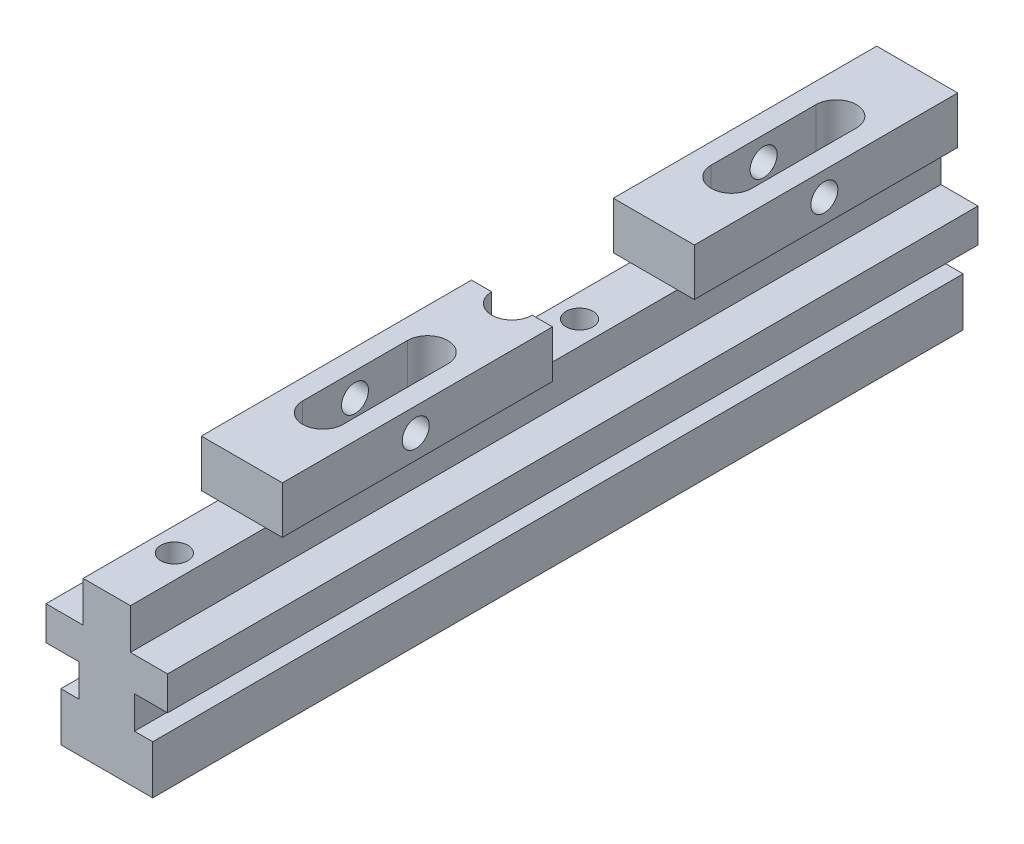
ISO-10303-21;
HEADER;
FILE_DESCRIPTION(('STEP AP214'),'2;1');
FILE_NAME('part.step','',(''),(''),'','','');
FILE_SCHEMA(('AUTOMOTIVE_DESIGN { 1 0 10303 214 1 1 1 1 }'));
ENDSEC;
DATA;
#1=APPLICATION_CONTEXT('core data for automotive mechanical design processes');
#2=APPLICATION_PROTOCOL_DEFINITION('international standard','automotive_design',2000,#1);
#3=PRODUCT_CONTEXT('',#1,'mechanical');
#4=PRODUCT('Part','Part','',(#3));
#5=PRODUCT_RELATED_PRODUCT_CATEGORY('part','',(#4));
#6=PRODUCT_DEFINITION_FORMATION('','',#4);
#7=PRODUCT_DEFINITION_CONTEXT('part definition',#1,'design');
#8=PRODUCT_DEFINITION('design','',#6,#7);
#9=PRODUCT_DEFINITION_SHAPE('','',#8);
#10=(LENGTH_UNIT() NAMED_UNIT(*) SI_UNIT(.MILLI.,.METRE.));
#11=(NAMED_UNIT(*) PLANE_ANGLE_UNIT() SI_UNIT($,.RADIAN.));
#12=(NAMED_UNIT(*) SI_UNIT($,.STERADIAN.) SOLID_ANGLE_UNIT());
#13=UNCERTAINTY_MEASURE_WITH_UNIT(LENGTH_MEASURE(1.E-05),#10,'distance_accuracy_value','');
#14=(GEOMETRIC_REPRESENTATION_CONTEXT(3) GLOBAL_UNCERTAINTY_ASSIGNED_CONTEXT((#13)) GLOBAL_UNIT_ASSIGNED_CONTEXT((#10,
#11,#12)) REPRESENTATION_CONTEXT('',''));
#15=CARTESIAN_POINT('',(0.,0.,0.));
#16=DIRECTION('',(0.,0.,1.));
#17=DIRECTION('',(1.,0.,0.));
#18=AXIS2_PLACEMENT_3D('',#15,#16,#17);
#19=CARTESIAN_POINT('',(0.,1.99999999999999,20.25));
#20=DIRECTION('',(0.,1.,0.));
#21=DIRECTION('',(0.,0.,1.));
#22=AXIS2_PLACEMENT_3D('',#19,#20,#21);
#23=PLANE('',#22);
#24=DIRECTION('',(0.,0.,1.));
#25=VECTOR('',#24,1.);
#26=CARTESIAN_POINT('',(-3.,1.99999999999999,12.5));
#27=LINE('',#26,#25);
#28=CARTESIAN_POINT('',(-3.,1.99999999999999,12.5));
#29=VERTEX_POINT('',#28);
#30=CARTESIAN_POINT('',(-3.,1.99999999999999,28.));
#31=VERTEX_POINT('',#30);
#32=EDGE_CURVE('E267',#29,#31,#27,.T.);
#33=ORIENTED_EDGE('',*,*,#32,.T.);
#34=CARTESIAN_POINT('',(0.,1.99999999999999,28.));
#35=DIRECTION('',(0.,-1.,0.));
#36=DIRECTION('',(0.,0.,-1.));
#37=AXIS2_PLACEMENT_3D('',#34,#35,#36);
#38=CIRCLE('',#37,3.);
#39=CARTESIAN_POINT('',(3.,1.99999999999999,28.));
#40=VERTEX_POINT('',#39);
#41=EDGE_CURVE('E252',#31,#40,#38,.F.);
#42=ORIENTED_EDGE('',*,*,#41,.T.);
#43=DIRECTION('',(0.,0.,-1.));
#44=VECTOR('',#43,1.);
#45=CARTESIAN_POINT('',(3.,1.99999999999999,28.));
#46=LINE('',#45,#44);
#47=CARTESIAN_POINT('',(3.,1.99999999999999,12.5));
#48=VERTEX_POINT('',#47);
#49=EDGE_CURVE('E257',#40,#48,#46,.T.);
#50=ORIENTED_EDGE('',*,*,#49,.T.);
#51=CARTESIAN_POINT('',(0.,1.99999999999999,12.5));
#52=DIRECTION('',(0.,-1.,0.));
#53=DIRECTION('',(0.,0.,-1.));
#54=AXIS2_PLACEMENT_3D('',#51,#52,#53);
#55=CIRCLE('',#54,3.);
#56=EDGE_CURVE('E378',#48,#29,#55,.F.);
#57=ORIENTED_EDGE('',*,*,#56,.T.);
#58=EDGE_LOOP('',(#33,#42,#50,#57));
#59=FACE_BOUND('',#58,.T.);
#60=ADVANCED_FACE('F15',(#59),#23,.T.);
#61=CARTESIAN_POINT('',(6.,9.49999999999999,20.25));
#62=DIRECTION('',(-1.,0.,0.));
#63=DIRECTION('',(0.,0.,1.));
#64=AXIS2_PLACEMENT_3D('',#61,#62,#63);
#65=CYLINDRICAL_SURFACE('',#64,2.);
#66=CARTESIAN_POINT('',(6.,9.49999999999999,20.25));
#67=DIRECTION('',(-1.,0.,0.));
#68=DIRECTION('',(0.,0.,1.));
#69=AXIS2_PLACEMENT_3D('',#66,#67,#68);
#70=CIRCLE('',#69,2.);
#71=CARTESIAN_POINT('',(6.,9.49999999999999,22.25));
#72=VERTEX_POINT('',#71);
#73=EDGE_CURVE('E375',#72,#72,#70,.T.);
#74=ORIENTED_EDGE('',*,*,#73,.F.);
#75=EDGE_LOOP('',(#74));
#76=FACE_BOUND('',#75,.T.);
#77=CARTESIAN_POINT('',(3.,9.49999999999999,20.25));
#78=DIRECTION('',(-1.,0.,0.));
#79=DIRECTION('',(0.,0.,1.));
#80=AXIS2_PLACEMENT_3D('',#77,#78,#79);
#81=CIRCLE('',#80,2.);
#82=CARTESIAN_POINT('',(3.,9.49999999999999,22.25));
#83=VERTEX_POINT('',#82);
#84=EDGE_CURVE('E19',#83,#83,#81,.T.);
#85=ORIENTED_EDGE('',*,*,#84,.T.);
#86=EDGE_LOOP('',(#85));
#87=FACE_BOUND('',#86,.T.);
#88=ADVANCED_FACE('F669',(#76,#87),#65,.F.);
#89=CARTESIAN_POINT('',(6.,9.49999999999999,20.25));
#90=DIRECTION('',(-1.,0.,0.));
#91=DIRECTION('',(0.,0.,1.));
#92=AXIS2_PLACEMENT_3D('',#89,#90,#91);
#93=CYLINDRICAL_SURFACE('',#92,2.);
#94=CARTESIAN_POINT('',(-3.,9.49999999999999,20.25));
#95=DIRECTION('',(-1.,0.,0.));
#96=DIRECTION('',(0.,0.,1.));
#97=AXIS2_PLACEMENT_3D('',#94,#95,#96);
#98=CIRCLE('',#97,2.);
#99=CARTESIAN_POINT('',(-3.,9.49999999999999,22.25));
#100=VERTEX_POINT('',#99);
#101=EDGE_CURVE('E294',#100,#100,#98,.F.);
#102=ORIENTED_EDGE('',*,*,#101,.T.);
#103=EDGE_LOOP('',(#102));
#104=FACE_BOUND('',#103,.T.);
#105=CARTESIAN_POINT('',(-6.,9.49999999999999,20.25));
#106=DIRECTION('',(-1.,0.,0.));
#107=DIRECTION('',(0.,0.,1.));
#108=AXIS2_PLACEMENT_3D('',#105,#106,#107);
#109=CIRCLE('',#108,2.);
#110=CARTESIAN_POINT('',(-6.,9.49999999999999,22.25));
#111=VERTEX_POINT('',#110);
#112=EDGE_CURVE('E372',#111,#111,#109,.F.);
#113=ORIENTED_EDGE('',*,*,#112,.F.);
#114=EDGE_LOOP('',(#113));
#115=FACE_BOUND('',#114,.T.);
#116=ADVANCED_FACE('F672',(#104,#115),#93,.F.);
#117=CARTESIAN_POINT('',(0.,-8.,-10.));
#118=DIRECTION('',(0.,-1.,0.));
#119=DIRECTION('',(0.,0.,-1.));
#120=AXIS2_PLACEMENT_3D('',#117,#118,#119);
#121=PLANE('',#120);
#122=CARTESIAN_POINT('',(0.,-8.,-10.));
#123=DIRECTION('',(0.,-1.,0.));
#124=DIRECTION('',(0.,0.,-1.));
#125=AXIS2_PLACEMENT_3D('',#122,#123,#124);
#126=CIRCLE('',#125,2.);
#127=CARTESIAN_POINT('',(0.,-8.,-12.));
#128=VERTEX_POINT('',#127);
#129=EDGE_CURVE('E368',#128,#128,#126,.F.);
#130=ORIENTED_EDGE('',*,*,#129,.T.);
#131=EDGE_LOOP('',(#130));
#132=FACE_BOUND('',#131,.T.);
#133=ADVANCED_FACE('F676',(#132),#121,.F.);
#134=CARTESIAN_POINT('',(3.,13.,28.));
#135=DIRECTION('',(1.,0.,0.));
#136=DIRECTION('',(0.,0.,-1.));
#137=AXIS2_PLACEMENT_3D('',#134,#135,#136);
#138=PLANE('',#137);
#139=ORIENTED_EDGE('',*,*,#84,.F.);
#140=EDGE_LOOP('',(#139));
#141=FACE_BOUND('',#140,.T.);
#142=DIRECTION('',(0.,-1.,0.));
#143=VECTOR('',#142,1.);
#144=CARTESIAN_POINT('',(3.,13.,28.));
#145=LINE('',#144,#143);
#146=CARTESIAN_POINT('',(3.,13.,28.));
#147=VERTEX_POINT('',#146);
#148=EDGE_CURVE('E259',#40,#147,#145,.F.);
#149=ORIENTED_EDGE('',*,*,#148,.T.);
#150=DIRECTION('',(0.,0.,1.));
#151=VECTOR('',#150,1.);
#152=CARTESIAN_POINT('',(3.,13.,0.));
#153=LINE('',#152,#151);
#154=CARTESIAN_POINT('',(3.,13.,12.5));
#155=VERTEX_POINT('',#154);
#156=EDGE_CURVE('E367',#155,#147,#153,.T.);
#157=ORIENTED_EDGE('',*,*,#156,.F.);
#158=DIRECTION('',(0.,-1.,0.));
#159=VECTOR('',#158,1.);
#160=CARTESIAN_POINT('',(3.,13.,12.5));
#161=LINE('',#160,#159);
#162=EDGE_CURVE('E262',#155,#48,#161,.T.);
#163=ORIENTED_EDGE('',*,*,#162,.T.);
#164=ORIENTED_EDGE('',*,*,#49,.F.);
#165=EDGE_LOOP('',(#149,#157,#163,#164));
#166=FACE_BOUND('',#165,.T.);
#167=ADVANCED_FACE('F258',(#141,#166),#138,.F.);
#168=CARTESIAN_POINT('',(0.,13.,28.));
#169=DIRECTION('',(0.,-1.,0.));
#170=DIRECTION('',(0.,0.,-1.));
#171=AXIS2_PLACEMENT_3D('',#168,#169,#170);
#172=CYLINDRICAL_SURFACE('',#171,3.);
#173=DIRECTION('',(0.,1.,0.));
#174=VECTOR('',#173,1.);
#175=CARTESIAN_POINT('',(-3.,13.,28.));
#176=LINE('',#175,#174);
#177=CARTESIAN_POINT('',(-3.,13.,28.));
#178=VERTEX_POINT('',#177);
#179=EDGE_CURVE('E269',#31,#178,#176,.T.);
#180=ORIENTED_EDGE('',*,*,#179,.T.);
#181=CARTESIAN_POINT('',(0.,13.,28.));
#182=DIRECTION('',(0.,-1.,0.));
#183=DIRECTION('',(0.,0.,-1.));
#184=AXIS2_PLACEMENT_3D('',#181,#182,#183);
#185=CIRCLE('',#184,3.);
#186=EDGE_CURVE('E272',#147,#178,#185,.T.);
#187=ORIENTED_EDGE('',*,*,#186,.F.);
#188=ORIENTED_EDGE('',*,*,#148,.F.);
#189=ORIENTED_EDGE('',*,*,#41,.F.);
#190=EDGE_LOOP('',(#180,#187,#188,#189));
#191=FACE_BOUND('',#190,.T.);
#192=ADVANCED_FACE('F270',(#191),#172,.F.);
#193=CARTESIAN_POINT('',(-3.,13.,12.5));
#194=DIRECTION('',(-1.,0.,0.));
#195=DIRECTION('',(0.,0.,1.));
#196=AXIS2_PLACEMENT_3D('',#193,#194,#195);
#197=PLANE('',#196);
#198=ORIENTED_EDGE('',*,*,#101,.F.);
#199=EDGE_LOOP('',(#198));
#200=FACE_BOUND('',#199,.T.);
#201=DIRECTION('',(0.,-1.,0.));
#202=VECTOR('',#201,1.);
#203=CARTESIAN_POINT('',(-3.,13.,12.5));
#204=LINE('',#203,#202);
#205=CARTESIAN_POINT('',(-3.,13.,12.5));
#206=VERTEX_POINT('',#205);
#207=EDGE_CURVE('E381',#29,#206,#204,.F.);
#208=ORIENTED_EDGE('',*,*,#207,.T.);
#209=DIRECTION('',(0.,0.,1.));
#210=VECTOR('',#209,1.);
#211=CARTESIAN_POINT('',(-3.,13.,0.));
#212=LINE('',#211,#210);
#213=EDGE_CURVE('E365',#178,#206,#212,.F.);
#214=ORIENTED_EDGE('',*,*,#213,.F.);
#215=ORIENTED_EDGE('',*,*,#179,.F.);
#216=ORIENTED_EDGE('',*,*,#32,.F.);
#217=EDGE_LOOP('',(#208,#214,#215,#216));
#218=FACE_BOUND('',#217,.T.);
#219=ADVANCED_FACE('F685',(#200,#218),#197,.F.);
#220=CARTESIAN_POINT('',(0.,13.,12.5));
#221=DIRECTION('',(0.,-1.,0.));
#222=DIRECTION('',(0.,0.,-1.));
#223=AXIS2_PLACEMENT_3D('',#220,#221,#222);
#224=CYLINDRICAL_SURFACE('',#223,3.);
#225=ORIENTED_EDGE('',*,*,#162,.F.);
#226=CARTESIAN_POINT('',(0.,13.,12.5));
#227=DIRECTION('',(0.,-1.,0.));
#228=DIRECTION('',(0.,0.,-1.));
#229=AXIS2_PLACEMENT_3D('',#226,#227,#228);
#230=CIRCLE('',#229,3.);
#231=EDGE_CURVE('E361',#206,#155,#230,.T.);
#232=ORIENTED_EDGE('',*,*,#231,.F.);
#233=ORIENTED_EDGE('',*,*,#207,.F.);
#234=ORIENTED_EDGE('',*,*,#56,.F.);
#235=EDGE_LOOP('',(#225,#232,#233,#234));
#236=FACE_BOUND('',#235,.T.);
#237=ADVANCED_FACE('F688',(#236),#224,.F.);
#238=CARTESIAN_POINT('',(0.,-8.,50.));
#239=DIRECTION('',(0.,-1.,0.));
#240=DIRECTION('',(0.,0.,-1.));
#241=AXIS2_PLACEMENT_3D('',#238,#239,#240);
#242=PLANE('',#241);
#243=CARTESIAN_POINT('',(0.,-8.,50.));
#244=DIRECTION('',(0.,-1.,0.));
#245=DIRECTION('',(0.,0.,-1.));
#246=AXIS2_PLACEMENT_3D('',#243,#244,#245);
#247=CIRCLE('',#246,2.);
#248=CARTESIAN_POINT('',(0.,-8.,48.));
#249=VERTEX_POINT('',#248);
#250=EDGE_CURVE('E292',#249,#249,#247,.F.);
#251=ORIENTED_EDGE('',*,*,#250,.T.);
#252=EDGE_LOOP('',(#251));
#253=FACE_BOUND('',#252,.T.);
#254=ADVANCED_FACE('F692',(#253),#242,.F.);
#255=CARTESIAN_POINT('',(6.,13.,0.));
#256=DIRECTION('',(1.,0.,0.));
#257=DIRECTION('',(0.,0.,-1.));
#258=AXIS2_PLACEMENT_3D('',#255,#256,#257);
#259=PLANE('',#258);
#260=ORIENTED_EDGE('',*,*,#73,.T.);
#261=EDGE_LOOP('',(#260));
#262=FACE_BOUND('',#261,.T.);
#263=DIRECTION('',(0.,1.,0.));
#264=VECTOR('',#263,1.);
#265=CARTESIAN_POINT('',(6.,6.,40.));
#266=LINE('',#265,#264);
#267=CARTESIAN_POINT('',(6.,13.,40.));
#268=VERTEX_POINT('',#267);
#269=CARTESIAN_POINT('',(6.,6.,40.));
#270=VERTEX_POINT('',#269);
#271=EDGE_CURVE('E287',#268,#270,#266,.F.);
#272=ORIENTED_EDGE('',*,*,#271,.T.);
#273=DIRECTION('',(0.,0.,-1.));
#274=VECTOR('',#273,1.);
#275=CARTESIAN_POINT('',(6.,6.,0.));
#276=LINE('',#275,#274);
#277=CARTESIAN_POINT('',(6.,6.,0.));
#278=VERTEX_POINT('',#277);
#279=EDGE_CURVE('E391',#278,#270,#276,.F.);
#280=ORIENTED_EDGE('',*,*,#279,.F.);
#281=DIRECTION('',(0.,1.,0.));
#282=VECTOR('',#281,1.);
#283=CARTESIAN_POINT('',(6.,13.,0.));
#284=LINE('',#283,#282);
#285=CARTESIAN_POINT('',(6.,13.,0.));
#286=VERTEX_POINT('',#285);
#287=EDGE_CURVE('E371',#278,#286,#284,.T.);
#288=ORIENTED_EDGE('',*,*,#287,.T.);
#289=DIRECTION('',(0.,0.,1.));
#290=VECTOR('',#289,1.);
#291=CARTESIAN_POINT('',(6.,13.,0.));
#292=LINE('',#291,#290);
#293=EDGE_CURVE('E279',#268,#286,#292,.F.);
#294=ORIENTED_EDGE('',*,*,#293,.F.);
#295=EDGE_LOOP('',(#272,#280,#288,#294));
#296=FACE_BOUND('',#295,.T.);
#297=ADVANCED_FACE('F696',(#262,#296),#259,.T.);
#298=CARTESIAN_POINT('',(0.,1.99999999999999,-40.25));
#299=DIRECTION('',(0.,1.,0.));
#300=DIRECTION('',(0.,0.,1.));
#301=AXIS2_PLACEMENT_3D('',#298,#299,#300);
#302=PLANE('',#301);
#303=DIRECTION('',(0.,0.,1.));
#304=VECTOR('',#303,1.);
#305=CARTESIAN_POINT('',(-3.,1.99999999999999,-48.));
#306=LINE('',#305,#304);
#307=CARTESIAN_POINT('',(-3.,1.99999999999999,-48.));
#308=VERTEX_POINT('',#307);
#309=CARTESIAN_POINT('',(-3.,1.99999999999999,-32.5));
#310=VERTEX_POINT('',#309);
#311=EDGE_CURVE('E396',#308,#310,#306,.T.);
#312=ORIENTED_EDGE('',*,*,#311,.T.);
#313=CARTESIAN_POINT('',(0.,1.99999999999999,-32.5));
#314=DIRECTION('',(0.,-1.,0.));
#315=DIRECTION('',(0.,0.,-1.));
#316=AXIS2_PLACEMENT_3D('',#313,#314,#315);
#317=CIRCLE('',#316,3.);
#318=CARTESIAN_POINT('',(3.,1.99999999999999,-32.5));
#319=VERTEX_POINT('',#318);
#320=EDGE_CURVE('E349',#310,#319,#317,.F.);
#321=ORIENTED_EDGE('',*,*,#320,.T.);
#322=DIRECTION('',(0.,0.,-1.));
#323=VECTOR('',#322,1.);
#324=CARTESIAN_POINT('',(3.,1.99999999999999,-32.5));
#325=LINE('',#324,#323);
#326=CARTESIAN_POINT('',(3.,1.99999999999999,-48.));
#327=VERTEX_POINT('',#326);
#328=EDGE_CURVE('E357',#319,#327,#325,.T.);
#329=ORIENTED_EDGE('',*,*,#328,.T.);
#330=CARTESIAN_POINT('',(0.,1.99999999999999,-48.));
#331=DIRECTION('',(0.,-1.,0.));
#332=DIRECTION('',(0.,0.,-1.));
#333=AXIS2_PLACEMENT_3D('',#330,#331,#332);
#334=CIRCLE('',#333,3.);
#335=EDGE_CURVE('E345',#327,#308,#334,.F.);
#336=ORIENTED_EDGE('',*,*,#335,.T.);
#337=EDGE_LOOP('',(#312,#321,#329,#336));
#338=FACE_BOUND('',#337,.T.);
#339=ADVANCED_FACE('F700',(#338),#302,.T.);
#340=CARTESIAN_POINT('',(-6.,6.,0.));
#341=DIRECTION('',(-1.,0.,0.));
#342=DIRECTION('',(0.,0.,1.));
#343=AXIS2_PLACEMENT_3D('',#340,#341,#342);
#344=PLANE('',#343);
#345=ORIENTED_EDGE('',*,*,#112,.T.);
#346=EDGE_LOOP('',(#345));
#347=FACE_BOUND('',#346,.T.);
#348=DIRECTION('',(0.,1.,0.));
#349=VECTOR('',#348,1.);
#350=CARTESIAN_POINT('',(-6.,6.,40.));
#351=LINE('',#350,#349);
#352=CARTESIAN_POINT('',(-6.,6.,40.));
#353=VERTEX_POINT('',#352);
#354=CARTESIAN_POINT('',(-6.,13.,40.));
#355=VERTEX_POINT('',#354);
#356=EDGE_CURVE('E290',#353,#355,#351,.T.);
#357=ORIENTED_EDGE('',*,*,#356,.T.);
#358=DIRECTION('',(0.,0.,1.));
#359=VECTOR('',#358,1.);
#360=CARTESIAN_POINT('',(-6.,13.,0.));
#361=LINE('',#360,#359);
#362=CARTESIAN_POINT('',(-6.,13.,0.));
#363=VERTEX_POINT('',#362);
#364=EDGE_CURVE('E283',#363,#355,#361,.T.);
#365=ORIENTED_EDGE('',*,*,#364,.F.);
#366=DIRECTION('',(0.,1.,0.));
#367=VECTOR('',#366,1.);
#368=CARTESIAN_POINT('',(-6.,13.,0.));
#369=LINE('',#368,#367);
#370=CARTESIAN_POINT('',(-6.,6.,0.));
#371=VERTEX_POINT('',#370);
#372=EDGE_CURVE('E288',#363,#371,#369,.F.);
#373=ORIENTED_EDGE('',*,*,#372,.T.);
#374=DIRECTION('',(0.,0.,-1.));
#375=VECTOR('',#374,1.);
#376=CARTESIAN_POINT('',(-6.,6.,0.));
#377=LINE('',#376,#375);
#378=EDGE_CURVE('E401',#353,#371,#377,.T.);
#379=ORIENTED_EDGE('',*,*,#378,.F.);
#380=EDGE_LOOP('',(#357,#365,#373,#379));
#381=FACE_BOUND('',#380,.T.);
#382=ADVANCED_FACE('F704',(#347,#381),#344,.T.);
#383=CARTESIAN_POINT('',(0.,6.,-10.));
#384=DIRECTION('',(0.,-1.,0.));
#385=DIRECTION('',(0.,0.,-1.));
#386=AXIS2_PLACEMENT_3D('',#383,#384,#385);
#387=CYLINDRICAL_SURFACE('',#386,2.);
#388=CARTESIAN_POINT('',(0.,6.,-10.));
#389=DIRECTION('',(0.,-1.,0.));
#390=DIRECTION('',(0.,0.,-1.));
#391=AXIS2_PLACEMENT_3D('',#388,#389,#390);
#392=CIRCLE('',#391,2.);
#393=CARTESIAN_POINT('',(0.,6.,-12.));
#394=VERTEX_POINT('',#393);
#395=EDGE_CURVE('E337',#394,#394,#392,.F.);
#396=ORIENTED_EDGE('',*,*,#395,.T.);
#397=EDGE_LOOP('',(#396));
#398=FACE_BOUND('',#397,.T.);
#399=ORIENTED_EDGE('',*,*,#129,.F.);
#400=EDGE_LOOP('',(#399));
#401=FACE_BOUND('',#400,.T.);
#402=ADVANCED_FACE('F708',(#398,#401),#387,.F.);
#403=CARTESIAN_POINT('',(6.,13.,0.));
#404=DIRECTION('',(0.,0.,1.));
#405=DIRECTION('',(1.,0.,0.));
#406=AXIS2_PLACEMENT_3D('',#403,#404,#405);
#407=PLANE('',#406);
#408=DIRECTION('',(1.,0.,0.));
#409=VECTOR('',#408,1.);
#410=CARTESIAN_POINT('',(-6.,13.,0.));
#411=LINE('',#410,#409);
#412=CARTESIAN_POINT('',(3.,13.,0.));
#413=VERTEX_POINT('',#412);
#414=EDGE_CURVE('E282',#286,#413,#411,.F.);
#415=ORIENTED_EDGE('',*,*,#414,.F.);
#416=ORIENTED_EDGE('',*,*,#287,.F.);
#417=DIRECTION('',(1.,0.,0.));
#418=VECTOR('',#417,1.);
#419=CARTESIAN_POINT('',(6.,6.,0.));
#420=LINE('',#419,#418);
#421=CARTESIAN_POINT('',(3.5,6.,0.));
#422=VERTEX_POINT('',#421);
#423=EDGE_CURVE('E360',#422,#278,#420,.T.);
#424=ORIENTED_EDGE('',*,*,#423,.F.);
#425=DIRECTION('',(1.,0.,0.));
#426=VECTOR('',#425,1.);
#427=CARTESIAN_POINT('',(6.,6.,0.));
#428=LINE('',#427,#426);
#429=CARTESIAN_POINT('',(3.,6.,0.));
#430=VERTEX_POINT('',#429);
#431=EDGE_CURVE('E340',#422,#430,#428,.F.);
#432=ORIENTED_EDGE('',*,*,#431,.T.);
#433=DIRECTION('',(0.,1.,0.));
#434=VECTOR('',#433,1.);
#435=CARTESIAN_POINT('',(3.,5.99999999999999,0.));
#436=LINE('',#435,#434);
#437=EDGE_CURVE('E333',#430,#413,#436,.T.);
#438=ORIENTED_EDGE('',*,*,#437,.T.);
#439=EDGE_LOOP('',(#415,#416,#424,#432,#438));
#440=FACE_BOUND('',#439,.T.);
#441=ADVANCED_FACE('F712',(#440),#407,.F.);
#442=CARTESIAN_POINT('',(-6.,13.,0.));
#443=DIRECTION('',(0.,1.,0.));
#444=DIRECTION('',(0.,0.,1.));
#445=AXIS2_PLACEMENT_3D('',#442,#443,#444);
#446=PLANE('',#445);
#447=ORIENTED_EDGE('',*,*,#213,.T.);
#448=ORIENTED_EDGE('',*,*,#231,.T.);
#449=ORIENTED_EDGE('',*,*,#156,.T.);
#450=ORIENTED_EDGE('',*,*,#186,.T.);
#451=EDGE_LOOP('',(#447,#448,#449,#450));
#452=FACE_BOUND('',#451,.T.);
#453=ORIENTED_EDGE('',*,*,#293,.T.);
#454=ORIENTED_EDGE('',*,*,#414,.T.);
#455=CARTESIAN_POINT('',(0.,13.,0.));
#456=DIRECTION('',(0.,-1.,0.));
#457=DIRECTION('',(0.,0.,-1.));
#458=AXIS2_PLACEMENT_3D('',#455,#456,#457);
#459=CIRCLE('',#458,3.);
#460=CARTESIAN_POINT('',(-3.,13.,0.));
#461=VERTEX_POINT('',#460);
#462=EDGE_CURVE('E330',#413,#461,#459,.T.);
#463=ORIENTED_EDGE('',*,*,#462,.T.);
#464=DIRECTION('',(1.,0.,0.));
#465=VECTOR('',#464,1.);
#466=CARTESIAN_POINT('',(6.,13.,0.));
#467=LINE('',#466,#465);
#468=EDGE_CURVE('E364',#461,#363,#467,.F.);
#469=ORIENTED_EDGE('',*,*,#468,.T.);
#470=ORIENTED_EDGE('',*,*,#364,.T.);
#471=DIRECTION('',(-1.,0.,0.));
#472=VECTOR('',#471,1.);
#473=CARTESIAN_POINT('',(6.,13.,40.));
#474=LINE('',#473,#472);
#475=EDGE_CURVE('E284',#355,#268,#474,.F.);
#476=ORIENTED_EDGE('',*,*,#475,.T.);
#477=EDGE_LOOP('',(#453,#454,#463,#469,#470,#476));
#478=FACE_BOUND('',#477,.T.);
#479=ADVANCED_FACE('F716',(#452,#478),#446,.T.);
#480=CARTESIAN_POINT('',(6.,13.,0.));
#481=DIRECTION('',(0.,0.,1.));
#482=DIRECTION('',(1.,0.,0.));
#483=AXIS2_PLACEMENT_3D('',#480,#481,#482);
#484=PLANE('',#483);
#485=DIRECTION('',(1.,0.,0.));
#486=VECTOR('',#485,1.);
#487=CARTESIAN_POINT('',(6.,6.,0.));
#488=LINE('',#487,#486);
#489=CARTESIAN_POINT('',(-3.,6.,0.));
#490=VERTEX_POINT('',#489);
#491=CARTESIAN_POINT('',(-3.5,6.,0.));
#492=VERTEX_POINT('',#491);
#493=EDGE_CURVE('E404',#490,#492,#488,.F.);
#494=ORIENTED_EDGE('',*,*,#493,.T.);
#495=DIRECTION('',(1.,0.,0.));
#496=VECTOR('',#495,1.);
#497=CARTESIAN_POINT('',(-3.5,6.,0.));
#498=LINE('',#497,#496);
#499=EDGE_CURVE('E344',#371,#492,#498,.T.);
#500=ORIENTED_EDGE('',*,*,#499,.F.);
#501=ORIENTED_EDGE('',*,*,#372,.F.);
#502=ORIENTED_EDGE('',*,*,#468,.F.);
#503=DIRECTION('',(0.,-1.,0.));
#504=VECTOR('',#503,1.);
#505=CARTESIAN_POINT('',(-3.,5.99999999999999,0.));
#506=LINE('',#505,#504);
#507=EDGE_CURVE('E332',#461,#490,#506,.T.);
#508=ORIENTED_EDGE('',*,*,#507,.T.);
#509=EDGE_LOOP('',(#494,#500,#501,#502,#508));
#510=FACE_BOUND('',#509,.T.);
#511=ADVANCED_FACE('F720',(#510),#484,.F.);
#512=CARTESIAN_POINT('',(6.,6.,40.));
#513=DIRECTION('',(0.,0.,-1.));
#514=DIRECTION('',(-1.,0.,0.));
#515=AXIS2_PLACEMENT_3D('',#512,#513,#514);
#516=PLANE('',#515);
#517=DIRECTION('',(1.,0.,0.));
#518=VECTOR('',#517,1.);
#519=CARTESIAN_POINT('',(-3.5,6.,40.));
#520=LINE('',#519,#518);
#521=CARTESIAN_POINT('',(-3.5,6.,40.));
#522=VERTEX_POINT('',#521);
#523=EDGE_CURVE('E405',#522,#353,#520,.F.);
#524=ORIENTED_EDGE('',*,*,#523,.F.);
#525=DIRECTION('',(1.,0.,0.));
#526=VECTOR('',#525,1.);
#527=CARTESIAN_POINT('',(6.,6.,40.));
#528=LINE('',#527,#526);
#529=CARTESIAN_POINT('',(3.5,6.,40.));
#530=VERTEX_POINT('',#529);
#531=EDGE_CURVE('E329',#522,#530,#528,.T.);
#532=ORIENTED_EDGE('',*,*,#531,.T.);
#533=DIRECTION('',(1.,0.,0.));
#534=VECTOR('',#533,1.);
#535=CARTESIAN_POINT('',(6.,6.,40.));
#536=LINE('',#535,#534);
#537=EDGE_CURVE('E394',#270,#530,#536,.F.);
#538=ORIENTED_EDGE('',*,*,#537,.F.);
#539=ORIENTED_EDGE('',*,*,#271,.F.);
#540=ORIENTED_EDGE('',*,*,#475,.F.);
#541=ORIENTED_EDGE('',*,*,#356,.F.);
#542=EDGE_LOOP('',(#524,#532,#538,#539,#540,#541));
#543=FACE_BOUND('',#542,.T.);
#544=ADVANCED_FACE('F724',(#543),#516,.F.);
#545=CARTESIAN_POINT('',(0.,6.,50.));
#546=DIRECTION('',(0.,-1.,0.));
#547=DIRECTION('',(0.,0.,-1.));
#548=AXIS2_PLACEMENT_3D('',#545,#546,#547);
#549=CYLINDRICAL_SURFACE('',#548,2.);
#550=CARTESIAN_POINT('',(0.,6.,50.));
#551=DIRECTION('',(0.,-1.,0.));
#552=DIRECTION('',(0.,0.,-1.));
#553=AXIS2_PLACEMENT_3D('',#550,#551,#552);
#554=CIRCLE('',#553,2.);
#555=CARTESIAN_POINT('',(0.,6.,48.));
#556=VERTEX_POINT('',#555);
#557=EDGE_CURVE('E325',#556,#556,#554,.F.);
#558=ORIENTED_EDGE('',*,*,#557,.T.);
#559=EDGE_LOOP('',(#558));
#560=FACE_BOUND('',#559,.T.);
#561=ORIENTED_EDGE('',*,*,#250,.F.);
#562=EDGE_LOOP('',(#561));
#563=FACE_BOUND('',#562,.T.);
#564=ADVANCED_FACE('F728',(#560,#563),#549,.F.);
#565=CARTESIAN_POINT('',(6.,6.,0.));
#566=DIRECTION('',(0.,-1.,0.));
#567=DIRECTION('',(0.,0.,-1.));
#568=AXIS2_PLACEMENT_3D('',#565,#566,#567);
#569=PLANE('',#568);
#570=ORIENTED_EDGE('',*,*,#537,.T.);
#571=DIRECTION('',(0.,0.,-1.));
#572=VECTOR('',#571,1.);
#573=CARTESIAN_POINT('',(3.5,6.,0.));
#574=LINE('',#573,#572);
#575=EDGE_CURVE('E420',#422,#530,#574,.F.);
#576=ORIENTED_EDGE('',*,*,#575,.F.);
#577=ORIENTED_EDGE('',*,*,#423,.T.);
#578=ORIENTED_EDGE('',*,*,#279,.T.);
#579=EDGE_LOOP('',(#570,#576,#577,#578));
#580=FACE_BOUND('',#579,.T.);
#581=ADVANCED_FACE('F732',(#580),#569,.T.);
#582=CARTESIAN_POINT('',(6.,9.49999999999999,-40.25));
#583=DIRECTION('',(-1.,0.,0.));
#584=DIRECTION('',(0.,0.,1.));
#585=AXIS2_PLACEMENT_3D('',#582,#583,#584);
#586=CYLINDRICAL_SURFACE('',#585,2.);
#587=CARTESIAN_POINT('',(6.,9.49999999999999,-40.25));
#588=DIRECTION('',(-1.,0.,0.));
#589=DIRECTION('',(0.,0.,1.));
#590=AXIS2_PLACEMENT_3D('',#587,#588,#589);
#591=CIRCLE('',#590,2.);
#592=CARTESIAN_POINT('',(6.,9.49999999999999,-38.25));
#593=VERTEX_POINT('',#592);
#594=EDGE_CURVE('E320',#593,#593,#591,.T.);
#595=ORIENTED_EDGE('',*,*,#594,.F.);
#596=EDGE_LOOP('',(#595));
#597=FACE_BOUND('',#596,.T.);
#598=CARTESIAN_POINT('',(3.,9.49999999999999,-40.25));
#599=DIRECTION('',(-1.,0.,0.));
#600=DIRECTION('',(0.,0.,1.));
#601=AXIS2_PLACEMENT_3D('',#598,#599,#600);
#602=CIRCLE('',#601,2.);
#603=CARTESIAN_POINT('',(3.,9.49999999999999,-38.25));
#604=VERTEX_POINT('',#603);
#605=EDGE_CURVE('E354',#604,#604,#602,.T.);
#606=ORIENTED_EDGE('',*,*,#605,.T.);
#607=EDGE_LOOP('',(#606));
#608=FACE_BOUND('',#607,.T.);
#609=ADVANCED_FACE('F736',(#597,#608),#586,.F.);
#610=CARTESIAN_POINT('',(3.,13.,-32.5));
#611=DIRECTION('',(1.,0.,0.));
#612=DIRECTION('',(0.,0.,-1.));
#613=AXIS2_PLACEMENT_3D('',#610,#611,#612);
#614=PLANE('',#613);
#615=ORIENTED_EDGE('',*,*,#605,.F.);
#616=EDGE_LOOP('',(#615));
#617=FACE_BOUND('',#616,.T.);
#618=DIRECTION('',(0.,-1.,0.));
#619=VECTOR('',#618,1.);
#620=CARTESIAN_POINT('',(3.,13.,-32.5));
#621=LINE('',#620,#619);
#622=CARTESIAN_POINT('',(3.,13.,-32.5));
#623=VERTEX_POINT('',#622);
#624=EDGE_CURVE('E353',#319,#623,#621,.F.);
#625=ORIENTED_EDGE('',*,*,#624,.T.);
#626=DIRECTION('',(0.,0.,1.));
#627=VECTOR('',#626,1.);
#628=CARTESIAN_POINT('',(3.,13.,0.));
#629=LINE('',#628,#627);
#630=CARTESIAN_POINT('',(3.,13.,-48.));
#631=VERTEX_POINT('',#630);
#632=EDGE_CURVE('E319',#631,#623,#629,.T.);
#633=ORIENTED_EDGE('',*,*,#632,.F.);
#634=DIRECTION('',(0.,-1.,0.));
#635=VECTOR('',#634,1.);
#636=CARTESIAN_POINT('',(3.,13.,-48.));
#637=LINE('',#636,#635);
#638=EDGE_CURVE('E348',#631,#327,#637,.T.);
#639=ORIENTED_EDGE('',*,*,#638,.T.);
#640=ORIENTED_EDGE('',*,*,#328,.F.);
#641=EDGE_LOOP('',(#625,#633,#639,#640));
#642=FACE_BOUND('',#641,.T.);
#643=ADVANCED_FACE('F740',(#617,#642),#614,.F.);
#644=CARTESIAN_POINT('',(0.,13.,-32.5));
#645=DIRECTION('',(0.,-1.,0.));
#646=DIRECTION('',(0.,0.,-1.));
#647=AXIS2_PLACEMENT_3D('',#644,#645,#646);
#648=CYLINDRICAL_SURFACE('',#647,3.);
#649=DIRECTION('',(0.,1.,0.));
#650=VECTOR('',#649,1.);
#651=CARTESIAN_POINT('',(-3.,13.,-32.5));
#652=LINE('',#651,#650);
#653=CARTESIAN_POINT('',(-3.,13.,-32.5));
#654=VERTEX_POINT('',#653);
#655=EDGE_CURVE('E352',#310,#654,#652,.T.);
#656=ORIENTED_EDGE('',*,*,#655,.T.);
#657=CARTESIAN_POINT('',(0.,13.,-32.5));
#658=DIRECTION('',(0.,-1.,0.));
#659=DIRECTION('',(0.,0.,-1.));
#660=AXIS2_PLACEMENT_3D('',#657,#658,#659);
#661=CIRCLE('',#660,3.);
#662=EDGE_CURVE('E316',#623,#654,#661,.T.);
#663=ORIENTED_EDGE('',*,*,#662,.F.);
#664=ORIENTED_EDGE('',*,*,#624,.F.);
#665=ORIENTED_EDGE('',*,*,#320,.F.);
#666=EDGE_LOOP('',(#656,#663,#664,#665));
#667=FACE_BOUND('',#666,.T.);
#668=ADVANCED_FACE('F744',(#667),#648,.F.);
#669=CARTESIAN_POINT('',(-3.,13.,-48.));
#670=DIRECTION('',(-1.,0.,0.));
#671=DIRECTION('',(0.,0.,1.));
#672=AXIS2_PLACEMENT_3D('',#669,#670,#671);
#673=PLANE('',#672);
#674=CARTESIAN_POINT('',(-3.,9.49999999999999,-40.25));
#675=DIRECTION('',(-1.,0.,0.));
#676=DIRECTION('',(0.,0.,1.));
#677=AXIS2_PLACEMENT_3D('',#674,#675,#676);
#678=CIRCLE('',#677,2.);
#679=CARTESIAN_POINT('',(-3.,9.49999999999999,-38.25));
#680=VERTEX_POINT('',#679);
#681=EDGE_CURVE('E341',#680,#680,#678,.T.);
#682=ORIENTED_EDGE('',*,*,#681,.T.);
#683=EDGE_LOOP('',(#682));
#684=FACE_BOUND('',#683,.T.);
#685=DIRECTION('',(0.,-1.,0.));
#686=VECTOR('',#685,1.);
#687=CARTESIAN_POINT('',(-3.,13.,-48.));
#688=LINE('',#687,#686);
#689=CARTESIAN_POINT('',(-3.,13.,-48.));
#690=VERTEX_POINT('',#689);
#691=EDGE_CURVE('E399',#308,#690,#688,.F.);
#692=ORIENTED_EDGE('',*,*,#691,.T.);
#693=DIRECTION('',(0.,0.,1.));
#694=VECTOR('',#693,1.);
#695=CARTESIAN_POINT('',(-3.,13.,0.));
#696=LINE('',#695,#694);
#697=EDGE_CURVE('E315',#654,#690,#696,.F.);
#698=ORIENTED_EDGE('',*,*,#697,.F.);
#699=ORIENTED_EDGE('',*,*,#655,.F.);
#700=ORIENTED_EDGE('',*,*,#311,.F.);
#701=EDGE_LOOP('',(#692,#698,#699,#700));
#702=FACE_BOUND('',#701,.T.);
#703=ADVANCED_FACE('F748',(#684,#702),#673,.F.);
#704=CARTESIAN_POINT('',(0.,13.,-48.));
#705=DIRECTION('',(0.,-1.,0.));
#706=DIRECTION('',(0.,0.,-1.));
#707=AXIS2_PLACEMENT_3D('',#704,#705,#706);
#708=CYLINDRICAL_SURFACE('',#707,3.);
#709=ORIENTED_EDGE('',*,*,#638,.F.);
#710=CARTESIAN_POINT('',(0.,13.,-48.));
#711=DIRECTION('',(0.,-1.,0.));
#712=DIRECTION('',(0.,0.,-1.));
#713=AXIS2_PLACEMENT_3D('',#710,#711,#712);
#714=CIRCLE('',#713,3.);
#715=EDGE_CURVE('E311',#690,#631,#714,.T.);
#716=ORIENTED_EDGE('',*,*,#715,.F.);
#717=ORIENTED_EDGE('',*,*,#691,.F.);
#718=ORIENTED_EDGE('',*,*,#335,.F.);
#719=EDGE_LOOP('',(#709,#716,#717,#718));
#720=FACE_BOUND('',#719,.T.);
#721=ADVANCED_FACE('F752',(#720),#708,.F.);
#722=CARTESIAN_POINT('',(6.,9.49999999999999,-40.25));
#723=DIRECTION('',(-1.,0.,0.));
#724=DIRECTION('',(0.,0.,1.));
#725=AXIS2_PLACEMENT_3D('',#722,#723,#724);
#726=CYLINDRICAL_SURFACE('',#725,2.);
#727=ORIENTED_EDGE('',*,*,#681,.F.);
#728=EDGE_LOOP('',(#727));
#729=FACE_BOUND('',#728,.T.);
#730=CARTESIAN_POINT('',(-6.,9.49999999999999,-40.25));
#731=DIRECTION('',(-1.,0.,0.));
#732=DIRECTION('',(0.,0.,1.));
#733=AXIS2_PLACEMENT_3D('',#730,#731,#732);
#734=CIRCLE('',#733,2.);
#735=CARTESIAN_POINT('',(-6.,9.49999999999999,-38.25));
#736=VERTEX_POINT('',#735);
#737=EDGE_CURVE('E306',#736,#736,#734,.F.);
#738=ORIENTED_EDGE('',*,*,#737,.F.);
#739=EDGE_LOOP('',(#738));
#740=FACE_BOUND('',#739,.T.);
#741=ADVANCED_FACE('F756',(#729,#740),#726,.F.);
#742=CARTESIAN_POINT('',(6.,6.,-21.));
#743=DIRECTION('',(0.,0.,-1.));
#744=DIRECTION('',(-1.,0.,0.));
#745=AXIS2_PLACEMENT_3D('',#742,#743,#744);
#746=PLANE('',#745);
#747=DIRECTION('',(1.,0.,0.));
#748=VECTOR('',#747,1.);
#749=CARTESIAN_POINT('',(-3.5,6.,-21.));
#750=LINE('',#749,#748);
#751=CARTESIAN_POINT('',(-3.5,6.,-21.));
#752=VERTEX_POINT('',#751);
#753=CARTESIAN_POINT('',(-6.,6.,-21.));
#754=VERTEX_POINT('',#753);
#755=EDGE_CURVE('E309',#752,#754,#750,.F.);
#756=ORIENTED_EDGE('',*,*,#755,.F.);
#757=DIRECTION('',(1.,0.,0.));
#758=VECTOR('',#757,1.);
#759=CARTESIAN_POINT('',(6.,6.,-21.));
#760=LINE('',#759,#758);
#761=CARTESIAN_POINT('',(3.5,6.,-21.));
#762=VERTEX_POINT('',#761);
#763=EDGE_CURVE('E447',#752,#762,#760,.T.);
#764=ORIENTED_EDGE('',*,*,#763,.T.);
#765=DIRECTION('',(1.,0.,0.));
#766=VECTOR('',#765,1.);
#767=CARTESIAN_POINT('',(6.,6.,-21.));
#768=LINE('',#767,#766);
#769=CARTESIAN_POINT('',(6.,6.,-21.));
#770=VERTEX_POINT('',#769);
#771=EDGE_CURVE('E463',#770,#762,#768,.F.);
#772=ORIENTED_EDGE('',*,*,#771,.F.);
#773=DIRECTION('',(0.,1.,0.));
#774=VECTOR('',#773,1.);
#775=CARTESIAN_POINT('',(6.,13.,-21.));
#776=LINE('',#775,#774);
#777=CARTESIAN_POINT('',(6.,13.,-21.));
#778=VERTEX_POINT('',#777);
#779=EDGE_CURVE('E469',#778,#770,#776,.F.);
#780=ORIENTED_EDGE('',*,*,#779,.F.);
#781=DIRECTION('',(1.,0.,0.));
#782=VECTOR('',#781,1.);
#783=CARTESIAN_POINT('',(-6.,13.,-21.));
#784=LINE('',#783,#782);
#785=CARTESIAN_POINT('',(-6.,13.,-21.));
#786=VERTEX_POINT('',#785);
#787=EDGE_CURVE('E323',#786,#778,#784,.T.);
#788=ORIENTED_EDGE('',*,*,#787,.F.);
#789=DIRECTION('',(0.,1.,0.));
#790=VECTOR('',#789,1.);
#791=CARTESIAN_POINT('',(-6.,6.,-21.));
#792=LINE('',#791,#790);
#793=EDGE_CURVE('E314',#754,#786,#792,.T.);
#794=ORIENTED_EDGE('',*,*,#793,.F.);
#795=EDGE_LOOP('',(#756,#764,#772,#780,#788,#794));
#796=FACE_BOUND('',#795,.T.);
#797=ADVANCED_FACE('F760',(#796),#746,.F.);
#798=CARTESIAN_POINT('',(-3.5,6.,0.));
#799=DIRECTION('',(0.,-1.,0.));
#800=DIRECTION('',(0.,0.,-1.));
#801=AXIS2_PLACEMENT_3D('',#798,#799,#800);
#802=PLANE('',#801);
#803=ORIENTED_EDGE('',*,*,#523,.T.);
#804=ORIENTED_EDGE('',*,*,#378,.T.);
#805=ORIENTED_EDGE('',*,*,#499,.T.);
#806=DIRECTION('',(0.,0.,1.));
#807=VECTOR('',#806,1.);
#808=CARTESIAN_POINT('',(-3.5,6.,0.));
#809=LINE('',#808,#807);
#810=EDGE_CURVE('E407',#522,#492,#809,.F.);
#811=ORIENTED_EDGE('',*,*,#810,.F.);
#812=EDGE_LOOP('',(#803,#804,#805,#811));
#813=FACE_BOUND('',#812,.T.);
#814=ADVANCED_FACE('F662',(#813),#802,.T.);
#815=CARTESIAN_POINT('',(6.,6.,0.));
#816=DIRECTION('',(0.,-1.,0.));
#817=DIRECTION('',(0.,0.,-1.));
#818=AXIS2_PLACEMENT_3D('',#815,#816,#817);
#819=PLANE('',#818);
#820=ORIENTED_EDGE('',*,*,#395,.F.);
#821=EDGE_LOOP('',(#820));
#822=FACE_BOUND('',#821,.T.);
#823=ORIENTED_EDGE('',*,*,#431,.F.);
#824=DIRECTION('',(0.,0.,-1.));
#825=VECTOR('',#824,1.);
#826=CARTESIAN_POINT('',(3.5,6.,0.));
#827=LINE('',#826,#825);
#828=EDGE_CURVE('E417',#762,#422,#827,.F.);
#829=ORIENTED_EDGE('',*,*,#828,.F.);
#830=ORIENTED_EDGE('',*,*,#763,.F.);
#831=DIRECTION('',(0.,0.,1.));
#832=VECTOR('',#831,1.);
#833=CARTESIAN_POINT('',(-3.5,6.,0.));
#834=LINE('',#833,#832);
#835=EDGE_CURVE('E410',#492,#752,#834,.F.);
#836=ORIENTED_EDGE('',*,*,#835,.F.);
#837=ORIENTED_EDGE('',*,*,#493,.F.);
#838=CARTESIAN_POINT('',(0.,6.,0.));
#839=DIRECTION('',(0.,-1.,0.));
#840=DIRECTION('',(0.,0.,-1.));
#841=AXIS2_PLACEMENT_3D('',#838,#839,#840);
#842=CIRCLE('',#841,3.);
#843=EDGE_CURVE('E334',#490,#430,#842,.T.);
#844=ORIENTED_EDGE('',*,*,#843,.T.);
#845=EDGE_LOOP('',(#823,#829,#830,#836,#837,#844));
#846=FACE_BOUND('',#845,.T.);
#847=ADVANCED_FACE('F653',(#822,#846),#819,.F.);
#848=CARTESIAN_POINT('',(0.,13.,0.));
#849=DIRECTION('',(0.,-1.,0.));
#850=DIRECTION('',(0.,0.,-1.));
#851=AXIS2_PLACEMENT_3D('',#848,#849,#850);
#852=CYLINDRICAL_SURFACE('',#851,3.);
#853=ORIENTED_EDGE('',*,*,#462,.F.);
#854=ORIENTED_EDGE('',*,*,#437,.F.);
#855=ORIENTED_EDGE('',*,*,#843,.F.);
#856=ORIENTED_EDGE('',*,*,#507,.F.);
#857=EDGE_LOOP('',(#853,#854,#855,#856));
#858=FACE_BOUND('',#857,.T.);
#859=CARTESIAN_POINT('',(0.,-1.00000000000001,0.));
#860=DIRECTION('',(0.,-1.,0.));
#861=DIRECTION('',(0.,0.,-1.));
#862=AXIS2_PLACEMENT_3D('',#859,#860,#861);
#863=CIRCLE('',#862,3.);
#864=CARTESIAN_POINT('',(0.,-1.00000000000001,-3.));
#865=VERTEX_POINT('',#864);
#866=EDGE_CURVE('E301',#865,#865,#863,.T.);
#867=ORIENTED_EDGE('',*,*,#866,.T.);
#868=EDGE_LOOP('',(#867));
#869=FACE_BOUND('',#868,.T.);
#870=ADVANCED_FACE('F650',(#858,#869),#852,.F.);
#871=CARTESIAN_POINT('',(6.,6.,60.));
#872=DIRECTION('',(0.,-1.,0.));
#873=DIRECTION('',(0.,0.,-1.));
#874=AXIS2_PLACEMENT_3D('',#871,#872,#873);
#875=PLANE('',#874);
#876=ORIENTED_EDGE('',*,*,#557,.F.);
#877=EDGE_LOOP('',(#876));
#878=FACE_BOUND('',#877,.T.);
#879=ORIENTED_EDGE('',*,*,#531,.F.);
#880=DIRECTION('',(0.,0.,1.));
#881=VECTOR('',#880,1.);
#882=CARTESIAN_POINT('',(-3.5,6.,0.));
#883=LINE('',#882,#881);
#884=CARTESIAN_POINT('',(-3.5,6.,60.));
#885=VERTEX_POINT('',#884);
#886=EDGE_CURVE('E411',#885,#522,#883,.F.);
#887=ORIENTED_EDGE('',*,*,#886,.F.);
#888=DIRECTION('',(1.,0.,0.));
#889=VECTOR('',#888,1.);
#890=CARTESIAN_POINT('',(0.,6.,60.));
#891=LINE('',#890,#889);
#892=CARTESIAN_POINT('',(3.5,6.,60.));
#893=VERTEX_POINT('',#892);
#894=EDGE_CURVE('E304',#893,#885,#891,.F.);
#895=ORIENTED_EDGE('',*,*,#894,.F.);
#896=DIRECTION('',(0.,0.,-1.));
#897=VECTOR('',#896,1.);
#898=CARTESIAN_POINT('',(3.5,6.,0.));
#899=LINE('',#898,#897);
#900=EDGE_CURVE('E426',#530,#893,#899,.F.);
#901=ORIENTED_EDGE('',*,*,#900,.F.);
#902=EDGE_LOOP('',(#879,#887,#895,#901));
#903=FACE_BOUND('',#902,.T.);
#904=ADVANCED_FACE('F652',(#878,#903),#875,.F.);
#905=CARTESIAN_POINT('',(4.1,-5.,0.));
#906=DIRECTION('',(1.,0.,0.));
#907=DIRECTION('',(0.,0.,-1.));
#908=AXIS2_PLACEMENT_3D('',#905,#906,#907);
#909=PLANE('',#908);
#910=DIRECTION('',(0.,1.,0.));
#911=VECTOR('',#910,1.);
#912=CARTESIAN_POINT('',(4.1,-2.28698630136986,-60.));
#913=LINE('',#912,#911);
#914=CARTESIAN_POINT('',(4.1,-9.8,-60.));
#915=VERTEX_POINT('',#914);
#916=CARTESIAN_POINT('',(4.1,-5.,-60.));
#917=VERTEX_POINT('',#916);
#918=EDGE_CURVE('E558',#915,#917,#913,.T.);
#919=ORIENTED_EDGE('',*,*,#918,.T.);
#920=DIRECTION('',(0.,0.,-1.));
#921=VECTOR('',#920,1.);
#922=CARTESIAN_POINT('',(4.1,-5.,0.));
#923=LINE('',#922,#921);
#924=CARTESIAN_POINT('',(4.1,-5.,60.));
#925=VERTEX_POINT('',#924);
#926=EDGE_CURVE('E328',#925,#917,#923,.T.);
#927=ORIENTED_EDGE('',*,*,#926,.F.);
#928=DIRECTION('',(0.,1.,0.));
#929=VECTOR('',#928,1.);
#930=CARTESIAN_POINT('',(4.1,-2.28698630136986,60.));
#931=LINE('',#930,#929);
#932=CARTESIAN_POINT('',(4.1,-9.8,60.));
#933=VERTEX_POINT('',#932);
#934=EDGE_CURVE('E534',#933,#925,#931,.T.);
#935=ORIENTED_EDGE('',*,*,#934,.F.);
#936=DIRECTION('',(0.,0.,1.));
#937=VECTOR('',#936,1.);
#938=CARTESIAN_POINT('',(4.1,-9.8,0.));
#939=LINE('',#938,#937);
#940=EDGE_CURVE('E305',#915,#933,#939,.T.);
#941=ORIENTED_EDGE('',*,*,#940,.F.);
#942=EDGE_LOOP('',(#919,#927,#935,#941));
#943=FACE_BOUND('',#942,.T.);
#944=ADVANCED_FACE('F659',(#943),#909,.T.);
#945=CARTESIAN_POINT('',(9.,-5.,0.));
#946=DIRECTION('',(0.,-1.,0.));
#947=DIRECTION('',(0.,0.,-1.));
#948=AXIS2_PLACEMENT_3D('',#945,#946,#947);
#949=PLANE('',#948);
#950=DIRECTION('',(1.,0.,0.));
#951=VECTOR('',#950,1.);
#952=CARTESIAN_POINT('',(0.,-5.,-60.));
#953=LINE('',#952,#951);
#954=CARTESIAN_POINT('',(9.,-5.,-60.));
#955=VERTEX_POINT('',#954);
#956=EDGE_CURVE('E560',#917,#955,#953,.T.);
#957=ORIENTED_EDGE('',*,*,#956,.T.);
#958=DIRECTION('',(0.,0.,-1.));
#959=VECTOR('',#958,1.);
#960=CARTESIAN_POINT('',(9.,-5.,0.));
#961=LINE('',#960,#959);
#962=CARTESIAN_POINT('',(9.,-5.,60.));
#963=VERTEX_POINT('',#962);
#964=EDGE_CURVE('E453',#963,#955,#961,.T.);
#965=ORIENTED_EDGE('',*,*,#964,.F.);
#966=DIRECTION('',(1.,0.,0.));
#967=VECTOR('',#966,1.);
#968=CARTESIAN_POINT('',(0.,-5.,60.));
#969=LINE('',#968,#967);
#970=EDGE_CURVE('E537',#925,#963,#969,.T.);
#971=ORIENTED_EDGE('',*,*,#970,.F.);
#972=ORIENTED_EDGE('',*,*,#926,.T.);
#973=EDGE_LOOP('',(#957,#965,#971,#972));
#974=FACE_BOUND('',#973,.T.);
#975=ADVANCED_FACE('F770',(#974),#949,.T.);
#976=CARTESIAN_POINT('',(9.,0.,0.));
#977=DIRECTION('',(1.,0.,0.));
#978=DIRECTION('',(0.,0.,-1.));
#979=AXIS2_PLACEMENT_3D('',#976,#977,#978);
#980=PLANE('',#979);
#981=DIRECTION('',(0.,1.,0.));
#982=VECTOR('',#981,1.);
#983=CARTESIAN_POINT('',(9.,-2.28698630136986,-60.));
#984=LINE('',#983,#982);
#985=CARTESIAN_POINT('',(9.,0.,-60.));
#986=VERTEX_POINT('',#985);
#987=EDGE_CURVE('E562',#955,#986,#984,.T.);
#988=ORIENTED_EDGE('',*,*,#987,.T.);
#989=DIRECTION('',(0.,0.,1.));
#990=VECTOR('',#989,1.);
#991=CARTESIAN_POINT('',(9.,0.,0.));
#992=LINE('',#991,#990);
#993=CARTESIAN_POINT('',(9.,0.,60.));
#994=VERTEX_POINT('',#993);
#995=EDGE_CURVE('E456',#994,#986,#992,.F.);
#996=ORIENTED_EDGE('',*,*,#995,.F.);
#997=DIRECTION('',(0.,1.,0.));
#998=VECTOR('',#997,1.);
#999=CARTESIAN_POINT('',(9.,-2.28698630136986,60.));
#1000=LINE('',#999,#998);
#1001=EDGE_CURVE('E540',#963,#994,#1000,.T.);
#1002=ORIENTED_EDGE('',*,*,#1001,.F.);
#1003=ORIENTED_EDGE('',*,*,#964,.T.);
#1004=EDGE_LOOP('',(#988,#996,#1002,#1003));
#1005=FACE_BOUND('',#1004,.T.);
#1006=ADVANCED_FACE('F774',(#1005),#980,.T.);
#1007=CARTESIAN_POINT('',(3.5,0.,0.));
#1008=DIRECTION('',(0.,1.,0.));
#1009=DIRECTION('',(0.,0.,1.));
#1010=AXIS2_PLACEMENT_3D('',#1007,#1008,#1009);
#1011=PLANE('',#1010);
#1012=DIRECTION('',(1.,0.,0.));
#1013=VECTOR('',#1012,1.);
#1014=CARTESIAN_POINT('',(0.,0.,-60.));
#1015=LINE('',#1014,#1013);
#1016=CARTESIAN_POINT('',(3.5,0.,-60.));
#1017=VERTEX_POINT('',#1016);
#1018=EDGE_CURVE('E564',#986,#1017,#1015,.F.);
#1019=ORIENTED_EDGE('',*,*,#1018,.T.);
#1020=DIRECTION('',(0.,0.,-1.));
#1021=VECTOR('',#1020,1.);
#1022=CARTESIAN_POINT('',(3.5,0.,0.));
#1023=LINE('',#1022,#1021);
#1024=CARTESIAN_POINT('',(3.5,0.,60.));
#1025=VERTEX_POINT('',#1024);
#1026=EDGE_CURVE('E421',#1025,#1017,#1023,.T.);
#1027=ORIENTED_EDGE('',*,*,#1026,.F.);
#1028=DIRECTION('',(1.,0.,0.));
#1029=VECTOR('',#1028,1.);
#1030=CARTESIAN_POINT('',(0.,0.,60.));
#1031=LINE('',#1030,#1029);
#1032=EDGE_CURVE('E543',#994,#1025,#1031,.F.);
#1033=ORIENTED_EDGE('',*,*,#1032,.F.);
#1034=ORIENTED_EDGE('',*,*,#995,.T.);
#1035=EDGE_LOOP('',(#1019,#1027,#1033,#1034));
#1036=FACE_BOUND('',#1035,.T.);
#1037=ADVANCED_FACE('F778',(#1036),#1011,.T.);
#1038=CARTESIAN_POINT('',(3.5,6.,0.));
#1039=DIRECTION('',(1.,0.,0.));
#1040=DIRECTION('',(0.,0.,-1.));
#1041=AXIS2_PLACEMENT_3D('',#1038,#1039,#1040);
#1042=PLANE('',#1041);
#1043=ORIENTED_EDGE('',*,*,#575,.T.);
#1044=ORIENTED_EDGE('',*,*,#900,.T.);
#1045=DIRECTION('',(0.,1.,0.));
#1046=VECTOR('',#1045,1.);
#1047=CARTESIAN_POINT('',(3.5,-2.28698630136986,60.));
#1048=LINE('',#1047,#1046);
#1049=EDGE_CURVE('E546',#1025,#893,#1048,.T.);
#1050=ORIENTED_EDGE('',*,*,#1049,.F.);
#1051=ORIENTED_EDGE('',*,*,#1026,.T.);
#1052=DIRECTION('',(0.,1.,0.));
#1053=VECTOR('',#1052,1.);
#1054=CARTESIAN_POINT('',(3.5,-2.28698630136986,-60.));
#1055=LINE('',#1054,#1053);
#1056=CARTESIAN_POINT('',(3.5,6.,-60.));
#1057=VERTEX_POINT('',#1056);
#1058=EDGE_CURVE('E566',#1017,#1057,#1055,.T.);
#1059=ORIENTED_EDGE('',*,*,#1058,.T.);
#1060=DIRECTION('',(0.,0.,-1.));
#1061=VECTOR('',#1060,1.);
#1062=CARTESIAN_POINT('',(3.5,6.,0.));
#1063=LINE('',#1062,#1061);
#1064=EDGE_CURVE('E466',#762,#1057,#1063,.T.);
#1065=ORIENTED_EDGE('',*,*,#1064,.F.);
#1066=ORIENTED_EDGE('',*,*,#828,.T.);
#1067=EDGE_LOOP('',(#1043,#1044,#1050,#1051,#1059,#1065,#1066));
#1068=FACE_BOUND('',#1067,.T.);
#1069=ADVANCED_FACE('F782',(#1068),#1042,.T.);
#1070=CARTESIAN_POINT('',(6.,6.,0.));
#1071=DIRECTION('',(0.,-1.,0.));
#1072=DIRECTION('',(0.,0.,-1.));
#1073=AXIS2_PLACEMENT_3D('',#1070,#1071,#1072);
#1074=PLANE('',#1073);
#1075=DIRECTION('',(1.,0.,0.));
#1076=VECTOR('',#1075,1.);
#1077=CARTESIAN_POINT('',(0.,6.,-60.));
#1078=LINE('',#1077,#1076);
#1079=CARTESIAN_POINT('',(6.,6.,-60.));
#1080=VERTEX_POINT('',#1079);
#1081=EDGE_CURVE('E568',#1057,#1080,#1078,.T.);
#1082=ORIENTED_EDGE('',*,*,#1081,.T.);
#1083=DIRECTION('',(0.,0.,-1.));
#1084=VECTOR('',#1083,1.);
#1085=CARTESIAN_POINT('',(6.,6.,0.));
#1086=LINE('',#1085,#1084);
#1087=EDGE_CURVE('E324',#770,#1080,#1086,.T.);
#1088=ORIENTED_EDGE('',*,*,#1087,.F.);
#1089=ORIENTED_EDGE('',*,*,#771,.T.);
#1090=ORIENTED_EDGE('',*,*,#1064,.T.);
#1091=EDGE_LOOP('',(#1082,#1088,#1089,#1090));
#1092=FACE_BOUND('',#1091,.T.);
#1093=ADVANCED_FACE('F786',(#1092),#1074,.T.);
#1094=CARTESIAN_POINT('',(6.,13.,0.));
#1095=DIRECTION('',(1.,0.,0.));
#1096=DIRECTION('',(0.,0.,-1.));
#1097=AXIS2_PLACEMENT_3D('',#1094,#1095,#1096);
#1098=PLANE('',#1097);
#1099=ORIENTED_EDGE('',*,*,#594,.T.);
#1100=EDGE_LOOP('',(#1099));
#1101=FACE_BOUND('',#1100,.T.);
#1102=DIRECTION('',(0.,1.,0.));
#1103=VECTOR('',#1102,1.);
#1104=CARTESIAN_POINT('',(6.,-2.28698630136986,-60.));
#1105=LINE('',#1104,#1103);
#1106=CARTESIAN_POINT('',(6.,13.,-60.));
#1107=VERTEX_POINT('',#1106);
#1108=EDGE_CURVE('E570',#1080,#1107,#1105,.T.);
#1109=ORIENTED_EDGE('',*,*,#1108,.T.);
#1110=DIRECTION('',(0.,0.,1.));
#1111=VECTOR('',#1110,1.);
#1112=CARTESIAN_POINT('',(6.,13.,0.));
#1113=LINE('',#1112,#1111);
#1114=EDGE_CURVE('E476',#778,#1107,#1113,.F.);
#1115=ORIENTED_EDGE('',*,*,#1114,.F.);
#1116=ORIENTED_EDGE('',*,*,#779,.T.);
#1117=ORIENTED_EDGE('',*,*,#1087,.T.);
#1118=EDGE_LOOP('',(#1109,#1115,#1116,#1117));
#1119=FACE_BOUND('',#1118,.T.);
#1120=ADVANCED_FACE('F790',(#1101,#1119),#1098,.T.);
#1121=CARTESIAN_POINT('',(-6.,13.,0.));
#1122=DIRECTION('',(0.,1.,0.));
#1123=DIRECTION('',(0.,0.,1.));
#1124=AXIS2_PLACEMENT_3D('',#1121,#1122,#1123);
#1125=PLANE('',#1124);
#1126=ORIENTED_EDGE('',*,*,#697,.T.);
#1127=ORIENTED_EDGE('',*,*,#715,.T.);
#1128=ORIENTED_EDGE('',*,*,#632,.T.);
#1129=ORIENTED_EDGE('',*,*,#662,.T.);
#1130=EDGE_LOOP('',(#1126,#1127,#1128,#1129));
#1131=FACE_BOUND('',#1130,.T.);
#1132=DIRECTION('',(1.,0.,0.));
#1133=VECTOR('',#1132,1.);
#1134=CARTESIAN_POINT('',(0.,13.,-60.));
#1135=LINE('',#1134,#1133);
#1136=CARTESIAN_POINT('',(-6.,13.,-60.));
#1137=VERTEX_POINT('',#1136);
#1138=EDGE_CURVE('E572',#1107,#1137,#1135,.F.);
#1139=ORIENTED_EDGE('',*,*,#1138,.T.);
#1140=DIRECTION('',(0.,0.,1.));
#1141=VECTOR('',#1140,1.);
#1142=CARTESIAN_POINT('',(-6.,13.,0.));
#1143=LINE('',#1142,#1141);
#1144=EDGE_CURVE('E310',#786,#1137,#1143,.F.);
#1145=ORIENTED_EDGE('',*,*,#1144,.F.);
#1146=ORIENTED_EDGE('',*,*,#787,.T.);
#1147=ORIENTED_EDGE('',*,*,#1114,.T.);
#1148=EDGE_LOOP('',(#1139,#1145,#1146,#1147));
#1149=FACE_BOUND('',#1148,.T.);
#1150=ADVANCED_FACE('F794',(#1131,#1149),#1125,.T.);
#1151=CARTESIAN_POINT('',(-6.,6.,0.));
#1152=DIRECTION('',(-1.,0.,0.));
#1153=DIRECTION('',(0.,0.,1.));
#1154=AXIS2_PLACEMENT_3D('',#1151,#1152,#1153);
#1155=PLANE('',#1154);
#1156=ORIENTED_EDGE('',*,*,#737,.T.);
#1157=EDGE_LOOP('',(#1156));
#1158=FACE_BOUND('',#1157,.T.);
#1159=DIRECTION('',(0.,1.,0.));
#1160=VECTOR('',#1159,1.);
#1161=CARTESIAN_POINT('',(-6.,-2.28698630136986,-60.));
#1162=LINE('',#1161,#1160);
#1163=CARTESIAN_POINT('',(-6.,6.,-60.));
#1164=VERTEX_POINT('',#1163);
#1165=EDGE_CURVE('E574',#1137,#1164,#1162,.F.);
#1166=ORIENTED_EDGE('',*,*,#1165,.T.);
#1167=DIRECTION('',(0.,0.,-1.));
#1168=VECTOR('',#1167,1.);
#1169=CARTESIAN_POINT('',(-6.,6.,0.));
#1170=LINE('',#1169,#1168);
#1171=EDGE_CURVE('E489',#754,#1164,#1170,.T.);
#1172=ORIENTED_EDGE('',*,*,#1171,.F.);
#1173=ORIENTED_EDGE('',*,*,#793,.T.);
#1174=ORIENTED_EDGE('',*,*,#1144,.T.);
#1175=EDGE_LOOP('',(#1166,#1172,#1173,#1174));
#1176=FACE_BOUND('',#1175,.T.);
#1177=ADVANCED_FACE('F798',(#1158,#1176),#1155,.T.);
#1178=CARTESIAN_POINT('',(-3.5,6.,0.));
#1179=DIRECTION('',(0.,-1.,0.));
#1180=DIRECTION('',(0.,0.,-1.));
#1181=AXIS2_PLACEMENT_3D('',#1178,#1179,#1180);
#1182=PLANE('',#1181);
#1183=DIRECTION('',(1.,0.,0.));
#1184=VECTOR('',#1183,1.);
#1185=CARTESIAN_POINT('',(0.,6.,-60.));
#1186=LINE('',#1185,#1184);
#1187=CARTESIAN_POINT('',(-3.5,6.,-60.));
#1188=VERTEX_POINT('',#1187);
#1189=EDGE_CURVE('E576',#1164,#1188,#1186,.T.);
#1190=ORIENTED_EDGE('',*,*,#1189,.T.);
#1191=DIRECTION('',(0.,0.,1.));
#1192=VECTOR('',#1191,1.);
#1193=CARTESIAN_POINT('',(-3.5,6.,0.));
#1194=LINE('',#1193,#1192);
#1195=EDGE_CURVE('E414',#752,#1188,#1194,.F.);
#1196=ORIENTED_EDGE('',*,*,#1195,.F.);
#1197=ORIENTED_EDGE('',*,*,#755,.T.);
#1198=ORIENTED_EDGE('',*,*,#1171,.T.);
#1199=EDGE_LOOP('',(#1190,#1196,#1197,#1198));
#1200=FACE_BOUND('',#1199,.T.);
#1201=ADVANCED_FACE('F802',(#1200),#1182,.T.);
#1202=CARTESIAN_POINT('',(-3.5,0.,0.));
#1203=DIRECTION('',(-1.,0.,0.));
#1204=DIRECTION('',(0.,0.,1.));
#1205=AXIS2_PLACEMENT_3D('',#1202,#1203,#1204);
#1206=PLANE('',#1205);
#1207=DIRECTION('',(0.,1.,0.));
#1208=VECTOR('',#1207,1.);
#1209=CARTESIAN_POINT('',(-3.5,-2.28698630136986,-60.));
#1210=LINE('',#1209,#1208);
#1211=CARTESIAN_POINT('',(-3.5,0.,-60.));
#1212=VERTEX_POINT('',#1211);
#1213=EDGE_CURVE('E578',#1188,#1212,#1210,.F.);
#1214=ORIENTED_EDGE('',*,*,#1213,.T.);
#1215=DIRECTION('',(0.,0.,1.));
#1216=VECTOR('',#1215,1.);
#1217=CARTESIAN_POINT('',(-3.5,0.,0.));
#1218=LINE('',#1217,#1216);
#1219=CARTESIAN_POINT('',(-3.5,0.,60.));
#1220=VERTEX_POINT('',#1219);
#1221=EDGE_CURVE('E496',#1220,#1212,#1218,.F.);
#1222=ORIENTED_EDGE('',*,*,#1221,.F.);
#1223=DIRECTION('',(0.,1.,0.));
#1224=VECTOR('',#1223,1.);
#1225=CARTESIAN_POINT('',(-3.5,-2.28698630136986,60.));
#1226=LINE('',#1225,#1224);
#1227=EDGE_CURVE('E514',#885,#1220,#1226,.F.);
#1228=ORIENTED_EDGE('',*,*,#1227,.F.);
#1229=ORIENTED_EDGE('',*,*,#886,.T.);
#1230=ORIENTED_EDGE('',*,*,#810,.T.);
#1231=ORIENTED_EDGE('',*,*,#835,.T.);
#1232=ORIENTED_EDGE('',*,*,#1195,.T.);
#1233=EDGE_LOOP('',(#1214,#1222,#1228,#1229,#1230,#1231,#1232));
#1234=FACE_BOUND('',#1233,.T.);
#1235=ADVANCED_FACE('F806',(#1234),#1206,.T.);
#1236=CARTESIAN_POINT('',(-9.,0.,0.));
#1237=DIRECTION('',(0.,1.,0.));
#1238=DIRECTION('',(0.,0.,1.));
#1239=AXIS2_PLACEMENT_3D('',#1236,#1237,#1238);
#1240=PLANE('',#1239);
#1241=DIRECTION('',(1.,0.,0.));
#1242=VECTOR('',#1241,1.);
#1243=CARTESIAN_POINT('',(0.,0.,-60.));
#1244=LINE('',#1243,#1242);
#1245=CARTESIAN_POINT('',(-9.,0.,-60.));
#1246=VERTEX_POINT('',#1245);
#1247=EDGE_CURVE('E580',#1212,#1246,#1244,.F.);
#1248=ORIENTED_EDGE('',*,*,#1247,.T.);
#1249=DIRECTION('',(0.,0.,1.));
#1250=VECTOR('',#1249,1.);
#1251=CARTESIAN_POINT('',(-9.,0.,0.));
#1252=LINE('',#1251,#1250);
#1253=CARTESIAN_POINT('',(-9.,0.,60.));
#1254=VERTEX_POINT('',#1253);
#1255=EDGE_CURVE('E499',#1254,#1246,#1252,.F.);
#1256=ORIENTED_EDGE('',*,*,#1255,.F.);
#1257=DIRECTION('',(1.,0.,0.));
#1258=VECTOR('',#1257,1.);
#1259=CARTESIAN_POINT('',(0.,0.,60.));
#1260=LINE('',#1259,#1258);
#1261=EDGE_CURVE('E517',#1220,#1254,#1260,.F.);
#1262=ORIENTED_EDGE('',*,*,#1261,.F.);
#1263=ORIENTED_EDGE('',*,*,#1221,.T.);
#1264=EDGE_LOOP('',(#1248,#1256,#1262,#1263));
#1265=FACE_BOUND('',#1264,.T.);
#1266=ADVANCED_FACE('F810',(#1265),#1240,.T.);
#1267=CARTESIAN_POINT('',(-9.,-5.,0.));
#1268=DIRECTION('',(-1.,0.,0.));
#1269=DIRECTION('',(0.,0.,1.));
#1270=AXIS2_PLACEMENT_3D('',#1267,#1268,#1269);
#1271=PLANE('',#1270);
#1272=DIRECTION('',(0.,1.,0.));
#1273=VECTOR('',#1272,1.);
#1274=CARTESIAN_POINT('',(-9.,-2.28698630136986,-60.));
#1275=LINE('',#1274,#1273);
#1276=CARTESIAN_POINT('',(-9.,-5.,-60.));
#1277=VERTEX_POINT('',#1276);
#1278=EDGE_CURVE('E582',#1246,#1277,#1275,.F.);
#1279=ORIENTED_EDGE('',*,*,#1278,.T.);
#1280=DIRECTION('',(0.,0.,-1.));
#1281=VECTOR('',#1280,1.);
#1282=CARTESIAN_POINT('',(-9.,-5.,0.));
#1283=LINE('',#1282,#1281);
#1284=CARTESIAN_POINT('',(-9.,-5.,60.));
#1285=VERTEX_POINT('',#1284);
#1286=EDGE_CURVE('E502',#1285,#1277,#1283,.T.);
#1287=ORIENTED_EDGE('',*,*,#1286,.F.);
#1288=DIRECTION('',(0.,1.,0.));
#1289=VECTOR('',#1288,1.);
#1290=CARTESIAN_POINT('',(-9.,-2.28698630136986,60.));
#1291=LINE('',#1290,#1289);
#1292=EDGE_CURVE('E520',#1254,#1285,#1291,.F.);
#1293=ORIENTED_EDGE('',*,*,#1292,.F.);
#1294=ORIENTED_EDGE('',*,*,#1255,.T.);
#1295=EDGE_LOOP('',(#1279,#1287,#1293,#1294));
#1296=FACE_BOUND('',#1295,.T.);
#1297=ADVANCED_FACE('F814',(#1296),#1271,.T.);
#1298=CARTESIAN_POINT('',(-4.1,-5.,0.));
#1299=DIRECTION('',(0.,-1.,0.));
#1300=DIRECTION('',(0.,0.,-1.));
#1301=AXIS2_PLACEMENT_3D('',#1298,#1299,#1300);
#1302=PLANE('',#1301);
#1303=DIRECTION('',(1.,0.,0.));
#1304=VECTOR('',#1303,1.);
#1305=CARTESIAN_POINT('',(0.,-5.,-60.));
#1306=LINE('',#1305,#1304);
#1307=CARTESIAN_POINT('',(-4.1,-5.,-60.));
#1308=VERTEX_POINT('',#1307);
#1309=EDGE_CURVE('E584',#1277,#1308,#1306,.T.);
#1310=ORIENTED_EDGE('',*,*,#1309,.T.);
#1311=DIRECTION('',(0.,0.,1.));
#1312=VECTOR('',#1311,1.);
#1313=CARTESIAN_POINT('',(-4.1,-5.,0.));
#1314=LINE('',#1313,#1312);
#1315=CARTESIAN_POINT('',(-4.1,-5.,60.));
#1316=VERTEX_POINT('',#1315);
#1317=EDGE_CURVE('E505',#1316,#1308,#1314,.F.);
#1318=ORIENTED_EDGE('',*,*,#1317,.F.);
#1319=DIRECTION('',(1.,0.,0.));
#1320=VECTOR('',#1319,1.);
#1321=CARTESIAN_POINT('',(0.,-5.,60.));
#1322=LINE('',#1321,#1320);
#1323=EDGE_CURVE('E523',#1285,#1316,#1322,.T.);
#1324=ORIENTED_EDGE('',*,*,#1323,.F.);
#1325=ORIENTED_EDGE('',*,*,#1286,.T.);
#1326=EDGE_LOOP('',(#1310,#1318,#1324,#1325));
#1327=FACE_BOUND('',#1326,.T.);
#1328=ADVANCED_FACE('F818',(#1327),#1302,.T.);
#1329=CARTESIAN_POINT('',(-4.1,-9.8,0.));
#1330=DIRECTION('',(-1.,0.,0.));
#1331=DIRECTION('',(0.,0.,1.));
#1332=AXIS2_PLACEMENT_3D('',#1329,#1330,#1331);
#1333=PLANE('',#1332);
#1334=DIRECTION('',(0.,1.,0.));
#1335=VECTOR('',#1334,1.);
#1336=CARTESIAN_POINT('',(-4.1,-2.28698630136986,-60.));
#1337=LINE('',#1336,#1335);
#1338=CARTESIAN_POINT('',(-4.1,-9.8,-60.));
#1339=VERTEX_POINT('',#1338);
#1340=EDGE_CURVE('E586',#1308,#1339,#1337,.F.);
#1341=ORIENTED_EDGE('',*,*,#1340,.T.);
#1342=DIRECTION('',(0.,0.,1.));
#1343=VECTOR('',#1342,1.);
#1344=CARTESIAN_POINT('',(-4.1,-9.8,0.));
#1345=LINE('',#1344,#1343);
#1346=CARTESIAN_POINT('',(-4.1,-9.8,60.));
#1347=VERTEX_POINT('',#1346);
#1348=EDGE_CURVE('E508',#1347,#1339,#1345,.F.);
#1349=ORIENTED_EDGE('',*,*,#1348,.F.);
#1350=DIRECTION('',(0.,1.,0.));
#1351=VECTOR('',#1350,1.);
#1352=CARTESIAN_POINT('',(-4.1,-2.28698630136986,60.));
#1353=LINE('',#1352,#1351);
#1354=EDGE_CURVE('E526',#1316,#1347,#1353,.F.);
#1355=ORIENTED_EDGE('',*,*,#1354,.F.);
#1356=ORIENTED_EDGE('',*,*,#1317,.T.);
#1357=EDGE_LOOP('',(#1341,#1349,#1355,#1356));
#1358=FACE_BOUND('',#1357,.T.);
#1359=ADVANCED_FACE('F822',(#1358),#1333,.T.);
#1360=CARTESIAN_POINT('',(-6.8,-9.8,0.));
#1361=DIRECTION('',(0.,1.,0.));
#1362=DIRECTION('',(0.,0.,1.));
#1363=AXIS2_PLACEMENT_3D('',#1360,#1361,#1362);
#1364=PLANE('',#1363);
#1365=DIRECTION('',(1.,0.,0.));
#1366=VECTOR('',#1365,1.);
#1367=CARTESIAN_POINT('',(0.,-9.8,-60.));
#1368=LINE('',#1367,#1366);
#1369=CARTESIAN_POINT('',(-6.8,-9.8,-60.));
#1370=VERTEX_POINT('',#1369);
#1371=EDGE_CURVE('E588',#1339,#1370,#1368,.F.);
#1372=ORIENTED_EDGE('',*,*,#1371,.T.);
#1373=DIRECTION('',(0.,0.,1.));
#1374=VECTOR('',#1373,1.);
#1375=CARTESIAN_POINT('',(-6.8,-9.8,0.));
#1376=LINE('',#1375,#1374);
#1377=CARTESIAN_POINT('',(-6.8,-9.8,60.));
#1378=VERTEX_POINT('',#1377);
#1379=EDGE_CURVE('E552',#1378,#1370,#1376,.F.);
#1380=ORIENTED_EDGE('',*,*,#1379,.F.);
#1381=DIRECTION('',(1.,0.,0.));
#1382=VECTOR('',#1381,1.);
#1383=CARTESIAN_POINT('',(0.,-9.8,60.));
#1384=LINE('',#1383,#1382);
#1385=EDGE_CURVE('E529',#1347,#1378,#1384,.F.);
#1386=ORIENTED_EDGE('',*,*,#1385,.F.);
#1387=ORIENTED_EDGE('',*,*,#1348,.T.);
#1388=EDGE_LOOP('',(#1372,#1380,#1386,#1387));
#1389=FACE_BOUND('',#1388,.T.);
#1390=ADVANCED_FACE('F826',(#1389),#1364,.T.);
#1391=CARTESIAN_POINT('',(4.1,-9.8,0.));
#1392=DIRECTION('',(0.,1.,0.));
#1393=DIRECTION('',(0.,0.,1.));
#1394=AXIS2_PLACEMENT_3D('',#1391,#1392,#1393);
#1395=PLANE('',#1394);
#1396=DIRECTION('',(1.,0.,0.));
#1397=VECTOR('',#1396,1.);
#1398=CARTESIAN_POINT('',(0.,-9.8,-60.));
#1399=LINE('',#1398,#1397);
#1400=CARTESIAN_POINT('',(6.8,-9.8,-60.));
#1401=VERTEX_POINT('',#1400);
#1402=EDGE_CURVE('E555',#1401,#915,#1399,.F.);
#1403=ORIENTED_EDGE('',*,*,#1402,.T.);
#1404=ORIENTED_EDGE('',*,*,#940,.T.);
#1405=DIRECTION('',(1.,0.,0.));
#1406=VECTOR('',#1405,1.);
#1407=CARTESIAN_POINT('',(0.,-9.8,60.));
#1408=LINE('',#1407,#1406);
#1409=CARTESIAN_POINT('',(6.8,-9.8,60.));
#1410=VERTEX_POINT('',#1409);
#1411=EDGE_CURVE('E531',#1410,#933,#1408,.F.);
#1412=ORIENTED_EDGE('',*,*,#1411,.F.);
#1413=DIRECTION('',(0.,0.,-1.));
#1414=VECTOR('',#1413,1.);
#1415=CARTESIAN_POINT('',(6.8,-9.8,0.));
#1416=LINE('',#1415,#1414);
#1417=EDGE_CURVE('E300',#1401,#1410,#1416,.F.);
#1418=ORIENTED_EDGE('',*,*,#1417,.F.);
#1419=EDGE_LOOP('',(#1403,#1404,#1412,#1418));
#1420=FACE_BOUND('',#1419,.T.);
#1421=ADVANCED_FACE('F647',(#1420),#1395,.T.);
#1422=CARTESIAN_POINT('',(3.06,-1.00000000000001,3.06));
#1423=DIRECTION('',(0.,-1.,0.));
#1424=DIRECTION('',(-1.,0.,0.));
#1425=AXIS2_PLACEMENT_3D('',#1422,#1423,#1424);
#1426=PLANE('',#1425);
#1427=CARTESIAN_POINT('',(0.,-1.00000000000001,0.));
#1428=DIRECTION('',(0.,-1.,0.));
#1429=DIRECTION('',(0.,0.,-1.));
#1430=AXIS2_PLACEMENT_3D('',#1427,#1428,#1429);
#1431=CIRCLE('',#1430,2.5);
#1432=CARTESIAN_POINT('',(0.,-1.00000000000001,-2.5));
#1433=VERTEX_POINT('',#1432);
#1434=EDGE_CURVE('E296',#1433,#1433,#1431,.T.);
#1435=ORIENTED_EDGE('',*,*,#1434,.T.);
#1436=EDGE_LOOP('',(#1435));
#1437=FACE_BOUND('',#1436,.T.);
#1438=ORIENTED_EDGE('',*,*,#866,.F.);
#1439=EDGE_LOOP('',(#1438));
#1440=FACE_BOUND('',#1439,.T.);
#1441=ADVANCED_FACE('F17',(#1437,#1440),#1426,.F.);
#1442=CARTESIAN_POINT('',(0.,-2.28698630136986,60.));
#1443=DIRECTION('',(0.,0.,1.));
#1444=DIRECTION('',(1.,0.,0.));
#1445=AXIS2_PLACEMENT_3D('',#1442,#1443,#1444);
#1446=PLANE('',#1445);
#1447=ORIENTED_EDGE('',*,*,#1032,.T.);
#1448=ORIENTED_EDGE('',*,*,#1049,.T.);
#1449=ORIENTED_EDGE('',*,*,#894,.T.);
#1450=ORIENTED_EDGE('',*,*,#1227,.T.);
#1451=ORIENTED_EDGE('',*,*,#1261,.T.);
#1452=ORIENTED_EDGE('',*,*,#1292,.T.);
#1453=ORIENTED_EDGE('',*,*,#1323,.T.);
#1454=ORIENTED_EDGE('',*,*,#1354,.T.);
#1455=ORIENTED_EDGE('',*,*,#1385,.T.);
#1456=DIRECTION('',(0.,1.,0.));
#1457=VECTOR('',#1456,1.);
#1458=CARTESIAN_POINT('',(-6.8,-17.,60.));
#1459=LINE('',#1458,#1457);
#1460=CARTESIAN_POINT('',(-6.8,-17.,60.));
#1461=VERTEX_POINT('',#1460);
#1462=EDGE_CURVE('E549',#1461,#1378,#1459,.T.);
#1463=ORIENTED_EDGE('',*,*,#1462,.F.);
#1464=DIRECTION('',(1.,0.,0.));
#1465=VECTOR('',#1464,1.);
#1466=CARTESIAN_POINT('',(6.8,-17.,60.));
#1467=LINE('',#1466,#1465);
#1468=CARTESIAN_POINT('',(6.8,-17.,60.));
#1469=VERTEX_POINT('',#1468);
#1470=EDGE_CURVE('E299',#1469,#1461,#1467,.F.);
#1471=ORIENTED_EDGE('',*,*,#1470,.F.);
#1472=DIRECTION('',(0.,1.,0.));
#1473=VECTOR('',#1472,1.);
#1474=CARTESIAN_POINT('',(6.8,-9.8,60.));
#1475=LINE('',#1474,#1473);
#1476=EDGE_CURVE('E592',#1410,#1469,#1475,.F.);
#1477=ORIENTED_EDGE('',*,*,#1476,.F.);
#1478=ORIENTED_EDGE('',*,*,#1411,.T.);
#1479=ORIENTED_EDGE('',*,*,#934,.T.);
#1480=ORIENTED_EDGE('',*,*,#970,.T.);
#1481=ORIENTED_EDGE('',*,*,#1001,.T.);
#1482=EDGE_LOOP('',(#1447,#1448,#1449,#1450,#1451,#1452,#1453,#1454,#1455,#1463,#1471,#1477,
#1478,#1479,#1480,#1481));
#1483=FACE_BOUND('',#1482,.T.);
#1484=ADVANCED_FACE('F614',(#1483),#1446,.T.);
#1485=CARTESIAN_POINT('',(-6.8,-17.,0.));
#1486=DIRECTION('',(-1.,0.,0.));
#1487=DIRECTION('',(0.,0.,1.));
#1488=AXIS2_PLACEMENT_3D('',#1485,#1486,#1487);
#1489=PLANE('',#1488);
#1490=DIRECTION('',(0.,1.,0.));
#1491=VECTOR('',#1490,1.);
#1492=CARTESIAN_POINT('',(-6.8,-2.28698630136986,-60.));
#1493=LINE('',#1492,#1491);
#1494=CARTESIAN_POINT('',(-6.8,-17.,-60.));
#1495=VERTEX_POINT('',#1494);
#1496=EDGE_CURVE('E590',#1370,#1495,#1493,.F.);
#1497=ORIENTED_EDGE('',*,*,#1496,.T.);
#1498=DIRECTION('',(0.,0.,-1.));
#1499=VECTOR('',#1498,1.);
#1500=CARTESIAN_POINT('',(-6.8,-17.,0.));
#1501=LINE('',#1500,#1499);
#1502=EDGE_CURVE('E600',#1461,#1495,#1501,.T.);
#1503=ORIENTED_EDGE('',*,*,#1502,.F.);
#1504=ORIENTED_EDGE('',*,*,#1462,.T.);
#1505=ORIENTED_EDGE('',*,*,#1379,.T.);
#1506=EDGE_LOOP('',(#1497,#1503,#1504,#1505));
#1507=FACE_BOUND('',#1506,.T.);
#1508=ADVANCED_FACE('F619',(#1507),#1489,.T.);
#1509=CARTESIAN_POINT('',(0.,-2.28698630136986,-60.));
#1510=DIRECTION('',(0.,0.,1.));
#1511=DIRECTION('',(1.,0.,0.));
#1512=AXIS2_PLACEMENT_3D('',#1509,#1510,#1511);
#1513=PLANE('',#1512);
#1514=DIRECTION('',(1.,0.,0.));
#1515=VECTOR('',#1514,1.);
#1516=CARTESIAN_POINT('',(6.8,-17.,-60.));
#1517=LINE('',#1516,#1515);
#1518=CARTESIAN_POINT('',(6.8,-17.,-60.));
#1519=VERTEX_POINT('',#1518);
#1520=EDGE_CURVE('E603',#1495,#1519,#1517,.T.);
#1521=ORIENTED_EDGE('',*,*,#1520,.F.);
#1522=ORIENTED_EDGE('',*,*,#1496,.F.);
#1523=ORIENTED_EDGE('',*,*,#1371,.F.);
#1524=ORIENTED_EDGE('',*,*,#1340,.F.);
#1525=ORIENTED_EDGE('',*,*,#1309,.F.);
#1526=ORIENTED_EDGE('',*,*,#1278,.F.);
#1527=ORIENTED_EDGE('',*,*,#1247,.F.);
#1528=ORIENTED_EDGE('',*,*,#1213,.F.);
#1529=ORIENTED_EDGE('',*,*,#1189,.F.);
#1530=ORIENTED_EDGE('',*,*,#1165,.F.);
#1531=ORIENTED_EDGE('',*,*,#1138,.F.);
#1532=ORIENTED_EDGE('',*,*,#1108,.F.);
#1533=ORIENTED_EDGE('',*,*,#1081,.F.);
#1534=ORIENTED_EDGE('',*,*,#1058,.F.);
#1535=ORIENTED_EDGE('',*,*,#1018,.F.);
#1536=ORIENTED_EDGE('',*,*,#987,.F.);
#1537=ORIENTED_EDGE('',*,*,#956,.F.);
#1538=ORIENTED_EDGE('',*,*,#918,.F.);
#1539=ORIENTED_EDGE('',*,*,#1402,.F.);
#1540=DIRECTION('',(0.,1.,0.));
#1541=VECTOR('',#1540,1.);
#1542=CARTESIAN_POINT('',(6.8,-9.8,-60.));
#1543=LINE('',#1542,#1541);
#1544=EDGE_CURVE('E34',#1519,#1401,#1543,.T.);
#1545=ORIENTED_EDGE('',*,*,#1544,.F.);
#1546=EDGE_LOOP('',(#1521,#1522,#1523,#1524,#1525,#1526,#1527,#1528,#1529,#1530,#1531,#1532,
#1533,#1534,#1535,#1536,#1537,#1538,#1539,#1545));
#1547=FACE_BOUND('',#1546,.T.);
#1548=ADVANCED_FACE('F622',(#1547),#1513,.F.);
#1549=CARTESIAN_POINT('',(6.8,-9.8,0.));
#1550=DIRECTION('',(1.,0.,0.));
#1551=DIRECTION('',(0.,0.,-1.));
#1552=AXIS2_PLACEMENT_3D('',#1549,#1550,#1551);
#1553=PLANE('',#1552);
#1554=ORIENTED_EDGE('',*,*,#1544,.T.);
#1555=ORIENTED_EDGE('',*,*,#1417,.T.);
#1556=ORIENTED_EDGE('',*,*,#1476,.T.);
#1557=DIRECTION('',(0.,0.,-1.));
#1558=VECTOR('',#1557,1.);
#1559=CARTESIAN_POINT('',(6.8,-17.,0.));
#1560=LINE('',#1559,#1558);
#1561=EDGE_CURVE('E25',#1519,#1469,#1560,.F.);
#1562=ORIENTED_EDGE('',*,*,#1561,.F.);
#1563=EDGE_LOOP('',(#1554,#1555,#1556,#1562));
#1564=FACE_BOUND('',#1563,.T.);
#1565=ADVANCED_FACE('F610',(#1564),#1553,.T.);
#1566=CARTESIAN_POINT('',(0.,13.,0.));
#1567=DIRECTION('',(0.,-1.,0.));
#1568=DIRECTION('',(0.,0.,-1.));
#1569=AXIS2_PLACEMENT_3D('',#1566,#1567,#1568);
#1570=CYLINDRICAL_SURFACE('',#1569,2.5);
#1571=CARTESIAN_POINT('',(0.,-17.,0.));
#1572=DIRECTION('',(0.,-1.,0.));
#1573=DIRECTION('',(0.,0.,-1.));
#1574=AXIS2_PLACEMENT_3D('',#1571,#1572,#1573);
#1575=CIRCLE('',#1574,2.5);
#1576=CARTESIAN_POINT('',(0.,-17.,-2.5));
#1577=VERTEX_POINT('',#1576);
#1578=EDGE_CURVE('E10',#1577,#1577,#1575,.F.);
#1579=ORIENTED_EDGE('',*,*,#1578,.F.);
#1580=EDGE_LOOP('',(#1579));
#1581=FACE_BOUND('',#1580,.T.);
#1582=ORIENTED_EDGE('',*,*,#1434,.F.);
#1583=EDGE_LOOP('',(#1582));
#1584=FACE_BOUND('',#1583,.T.);
#1585=ADVANCED_FACE('F630',(#1581,#1584),#1570,.F.);
#1586=CARTESIAN_POINT('',(6.8,-17.,0.));
#1587=DIRECTION('',(0.,-1.,0.));
#1588=DIRECTION('',(0.,0.,-1.));
#1589=AXIS2_PLACEMENT_3D('',#1586,#1587,#1588);
#1590=PLANE('',#1589);
#1591=ORIENTED_EDGE('',*,*,#1578,.T.);
#1592=EDGE_LOOP('',(#1591));
#1593=FACE_BOUND('',#1592,.T.);
#1594=ORIENTED_EDGE('',*,*,#1520,.T.);
#1595=ORIENTED_EDGE('',*,*,#1561,.T.);
#1596=ORIENTED_EDGE('',*,*,#1470,.T.);
#1597=ORIENTED_EDGE('',*,*,#1502,.T.);
#1598=EDGE_LOOP('',(#1594,#1595,#1596,#1597));
#1599=FACE_BOUND('',#1598,.T.);
#1600=ADVANCED_FACE('F608',(#1593,#1599),#1590,.T.);
#1601=CLOSED_SHELL('',(#60,#88,#116,#133,#167,#192,#219,#237,#254,#297,#339,#382,#402,#441,#479,
#511,#544,#564,#581,#609,#643,#668,#703,#721,#741,#797,#814,#847,#870,#904,#944,#975,#1006,
#1037,#1069,#1093,#1120,#1150,#1177,#1201,#1235,#1266,#1297,#1328,#1359,#1390,#1421,#1441,#1484,
#1508,#1548,#1565,#1585,#1600));
#1602=MANIFOLD_SOLID_BREP('B1',#1601);
#1603=ADVANCED_BREP_SHAPE_REPRESENTATION('',(#18,#1602),#14);
#1604=SHAPE_DEFINITION_REPRESENTATION(#9,#1603);
ENDSEC;
END-ISO-10303-21;
